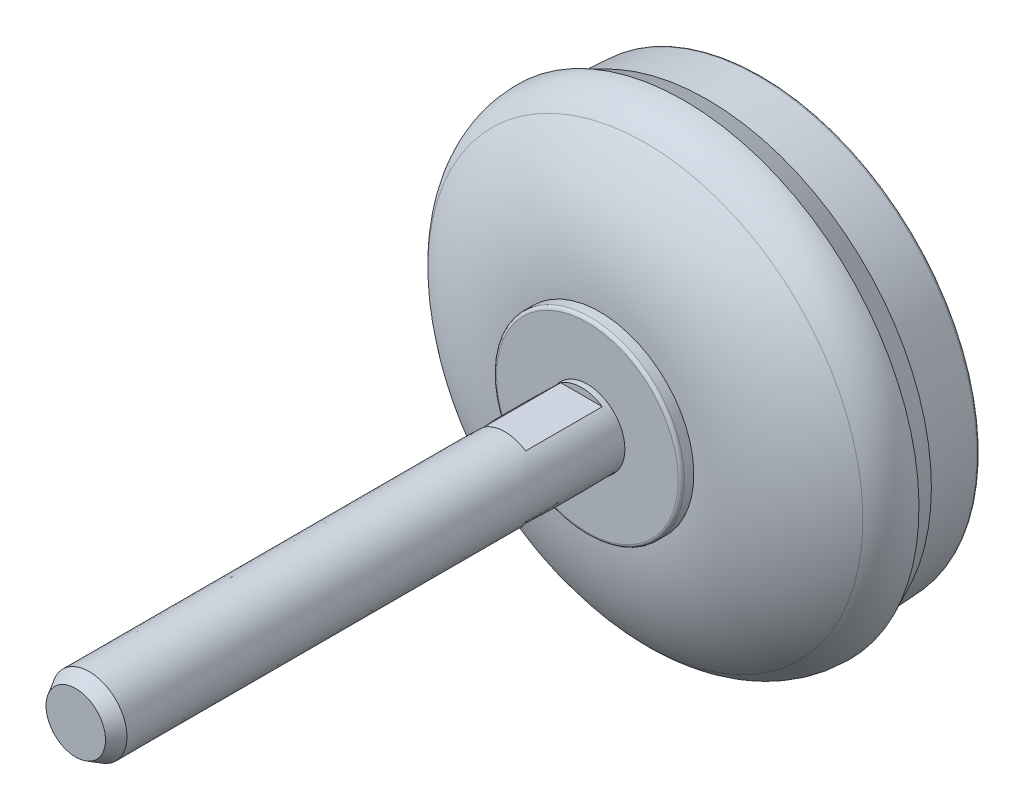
ISO-10303-21;
HEADER;
FILE_DESCRIPTION(('STEP AP214'),'2;1');
FILE_NAME('part.step','',(''),(''),'','','');
FILE_SCHEMA(('AUTOMOTIVE_DESIGN { 1 0 10303 214 1 1 1 1 }'));
ENDSEC;
DATA;
#1=APPLICATION_CONTEXT('core data for automotive mechanical design processes');
#2=APPLICATION_PROTOCOL_DEFINITION('international standard','automotive_design',2000,#1);
#3=PRODUCT_CONTEXT('',#1,'mechanical');
#4=PRODUCT('Part','Part','',(#3));
#5=PRODUCT_RELATED_PRODUCT_CATEGORY('part','',(#4));
#6=PRODUCT_DEFINITION_FORMATION('','',#4);
#7=PRODUCT_DEFINITION_CONTEXT('part definition',#1,'design');
#8=PRODUCT_DEFINITION('design','',#6,#7);
#9=PRODUCT_DEFINITION_SHAPE('','',#8);
#10=(LENGTH_UNIT() NAMED_UNIT(*) SI_UNIT(.MILLI.,.METRE.));
#11=(NAMED_UNIT(*) PLANE_ANGLE_UNIT() SI_UNIT($,.RADIAN.));
#12=(NAMED_UNIT(*) SI_UNIT($,.STERADIAN.) SOLID_ANGLE_UNIT());
#13=UNCERTAINTY_MEASURE_WITH_UNIT(LENGTH_MEASURE(1.E-05),#10,'distance_accuracy_value','');
#14=(GEOMETRIC_REPRESENTATION_CONTEXT(3) GLOBAL_UNCERTAINTY_ASSIGNED_CONTEXT((#13)) GLOBAL_UNIT_ASSIGNED_CONTEXT((#10,
#11,#12)) REPRESENTATION_CONTEXT('',''));
#15=CARTESIAN_POINT('',(0.,0.,0.));
#16=DIRECTION('',(0.,0.,1.));
#17=DIRECTION('',(1.,0.,0.));
#18=AXIS2_PLACEMENT_3D('',#15,#16,#17);
#19=CARTESIAN_POINT('',(32.3879992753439,228.506021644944,27.3305440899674));
#20=DIRECTION('',(2.62472022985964E-07,0.,-0.999999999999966));
#21=DIRECTION('',(-0.999999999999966,0.,-2.62472022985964E-07));
#22=AXIS2_PLACEMENT_3D('',#19,#20,#21);
#23=CONICAL_SURFACE('',#22,6.00001756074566,2.12237210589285E-07);
#24=CARTESIAN_POINT('',(32.3879784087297,228.506021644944,106.833632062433));
#25=DIRECTION('',(2.62462941E-07,0.,-0.999999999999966));
#26=DIRECTION('',(-0.999999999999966,0.,-2.62462941E-07));
#27=AXIS2_PLACEMENT_3D('',#24,#25,#26);
#28=CIRCLE('',#27,6.00000068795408);
#29=CARTESIAN_POINT('',(26.3879777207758,228.506021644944,106.833630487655));
#30=VERTEX_POINT('',#29);
#31=EDGE_CURVE('P0_E100',#30,#30,#28,.T.);
#32=ORIENTED_EDGE('',*,*,#31,.T.);
#33=EDGE_LOOP('',(#32));
#34=FACE_BOUND('',#33,.T.);
#35=CARTESIAN_POINT('',(32.3879992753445,228.506021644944,27.3305418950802));
#36=DIRECTION('',(-2.62462941E-07,0.,0.999999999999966));
#37=DIRECTION('',(0.999999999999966,0.,2.62462941E-07));
#38=AXIS2_PLACEMENT_3D('',#35,#36,#37);
#39=CIRCLE('',#38,6.00001756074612);
#40=CARTESIAN_POINT('',(38.3880168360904,228.506021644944,27.3305434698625));
#41=VERTEX_POINT('',#40);
#42=EDGE_CURVE('P0_E150',#41,#41,#39,.T.);
#43=ORIENTED_EDGE('',*,*,#42,.T.);
#44=EDGE_LOOP('',(#43));
#45=FACE_BOUND('',#44,.T.);
#46=CARTESIAN_POINT('',(32.3879990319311,228.506021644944,28.2579312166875));
#47=DIRECTION('',(0.,0.,1.));
#48=DIRECTION('',(1.,0.,0.));
#49=AXIS2_PLACEMENT_3D('',#46,#47,#48);
#50=CIRCLE('',#49,6.0000173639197);
#51=CARTESIAN_POINT('',(35.7046552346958,223.506021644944,28.2579312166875));
#52=VERTEX_POINT('',#51);
#53=CARTESIAN_POINT('',(29.0713448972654,223.506021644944,28.2579312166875));
#54=VERTEX_POINT('',#53);
#55=EDGE_CURVE('P0_E92',#52,#54,#50,.F.);
#56=ORIENTED_EDGE('',*,*,#55,.T.);
#57=CARTESIAN_POINT('',(29.0713415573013,223.506021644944,17.7879109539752));
#58=CARTESIAN_POINT('',(29.0713420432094,223.506021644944,21.7879214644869));
#59=CARTESIAN_POINT('',(29.0713425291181,223.506021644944,25.7879319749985));
#60=CARTESIAN_POINT('',(29.0713435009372,223.506021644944,33.7879529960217));
#61=CARTESIAN_POINT('',(29.0713439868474,223.506021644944,37.7879635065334));
#62=CARTESIAN_POINT('',(29.0713457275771,223.506021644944,52.1176190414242));
#63=CARTESIAN_POINT('',(29.0713469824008,223.506021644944,62.4472640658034));
#64=CARTESIAN_POINT('',(29.0713482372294,223.506021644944,72.7769090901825));
#65=B_SPLINE_CURVE_WITH_KNOTS('',3,(#57,#58,#59,#60,#61,#62,#63,#64),.UNSPECIFIED.,.F.,.F.,(4,2,
2,4),(0.,12.000031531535,24.0000630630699,54.9889981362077),.UNSPECIFIED.);
#66=CARTESIAN_POINT('',(29.0713448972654,223.506021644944,40.4980218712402));
#67=VERTEX_POINT('',#66);
#68=EDGE_CURVE('P0_E80',#54,#67,#65,.T.);
#69=ORIENTED_EDGE('',*,*,#68,.T.);
#70=CARTESIAN_POINT('',(32.3879958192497,228.506021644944,40.4980218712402));
#71=DIRECTION('',(0.,0.,-1.));
#72=DIRECTION('',(-1.,0.,0.));
#73=AXIS2_PLACEMENT_3D('',#70,#71,#72);
#74=CIRCLE('',#73,6.00001476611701);
#75=CARTESIAN_POINT('',(35.7046473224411,223.506021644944,40.4980218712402));
#76=VERTEX_POINT('',#75);
#77=EDGE_CURVE('P0_E88',#67,#76,#74,.F.);
#78=ORIENTED_EDGE('',*,*,#77,.T.);
#79=CARTESIAN_POINT('',(35.7046620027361,223.506021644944,17.7879103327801));
#80=CARTESIAN_POINT('',(35.7046594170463,223.506021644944,21.7879208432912));
#81=CARTESIAN_POINT('',(35.7046568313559,223.506021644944,25.7879313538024));
#82=CARTESIAN_POINT('',(35.7046516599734,223.506021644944,33.7879523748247));
#83=CARTESIAN_POINT('',(35.7046490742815,223.506021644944,37.7879628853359));
#84=CARTESIAN_POINT('',(35.7046398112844,223.506021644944,52.1176184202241));
#85=CARTESIAN_POINT('',(35.7046331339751,223.506021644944,62.4472634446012));
#86=CARTESIAN_POINT('',(35.7046264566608,223.506021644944,72.7769084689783));
#87=B_SPLINE_CURVE_WITH_KNOTS('',3,(#79,#80,#81,#82,#83,#84,#85,#86),.UNSPECIFIED.,.F.,.F.,(4,2,
2,4),(0.,12.000031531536,24.0000630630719,54.9889981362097),.UNSPECIFIED.);
#88=EDGE_CURVE('P0_E97',#76,#52,#87,.F.);
#89=ORIENTED_EDGE('',*,*,#88,.T.);
#90=EDGE_LOOP('',(#56,#69,#78,#89));
#91=FACE_BOUND('',#90,.T.);
#92=CARTESIAN_POINT('',(32.3879958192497,228.506021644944,40.4980218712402));
#93=DIRECTION('',(0.,0.,-1.));
#94=DIRECTION('',(-1.,0.,0.));
#95=AXIS2_PLACEMENT_3D('',#92,#93,#94);
#96=CIRCLE('',#95,6.00001476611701);
#97=CARTESIAN_POINT('',(35.7046473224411,233.506021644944,40.4980218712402));
#98=VERTEX_POINT('',#97);
#99=CARTESIAN_POINT('',(29.0713448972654,233.506021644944,40.4980218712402));
#100=VERTEX_POINT('',#99);
#101=EDGE_CURVE('P0_E460',#98,#100,#96,.F.);
#102=ORIENTED_EDGE('',*,*,#101,.T.);
#103=CARTESIAN_POINT('',(29.0713415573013,233.506021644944,17.7879109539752));
#104=CARTESIAN_POINT('',(29.0713420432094,233.506021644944,21.7879214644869));
#105=CARTESIAN_POINT('',(29.0713425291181,233.506021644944,25.7879319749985));
#106=CARTESIAN_POINT('',(29.0713435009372,233.506021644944,33.7879529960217));
#107=CARTESIAN_POINT('',(29.0713439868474,233.506021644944,37.7879635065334));
#108=CARTESIAN_POINT('',(29.0713457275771,233.506021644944,52.1176190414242));
#109=CARTESIAN_POINT('',(29.0713469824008,233.506021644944,62.4472640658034));
#110=CARTESIAN_POINT('',(29.0713482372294,233.506021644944,72.7769090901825));
#111=B_SPLINE_CURVE_WITH_KNOTS('',3,(#103,#104,#105,#106,#107,#108,#109,#110),.UNSPECIFIED.,.F.,
.F.,(4,2,2,4),(0.,12.000031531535,24.0000630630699,54.9889981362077),.UNSPECIFIED.);
#112=CARTESIAN_POINT('',(29.0713448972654,233.506021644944,28.2579312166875));
#113=VERTEX_POINT('',#112);
#114=EDGE_CURVE('P0_E11',#100,#113,#111,.F.);
#115=ORIENTED_EDGE('',*,*,#114,.T.);
#116=CARTESIAN_POINT('',(32.3879990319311,228.506021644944,28.2579312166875));
#117=DIRECTION('',(0.,0.,1.));
#118=DIRECTION('',(1.,0.,0.));
#119=AXIS2_PLACEMENT_3D('',#116,#117,#118);
#120=CIRCLE('',#119,6.0000173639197);
#121=CARTESIAN_POINT('',(35.7046552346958,233.506021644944,28.2579312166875));
#122=VERTEX_POINT('',#121);
#123=EDGE_CURVE('P0_E48',#113,#122,#120,.F.);
#124=ORIENTED_EDGE('',*,*,#123,.T.);
#125=CARTESIAN_POINT('',(35.7046620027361,233.506021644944,17.7879103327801));
#126=CARTESIAN_POINT('',(35.7046594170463,233.506021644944,21.7879208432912));
#127=CARTESIAN_POINT('',(35.7046568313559,233.506021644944,25.7879313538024));
#128=CARTESIAN_POINT('',(35.7046516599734,233.506021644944,33.7879523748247));
#129=CARTESIAN_POINT('',(35.7046490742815,233.506021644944,37.7879628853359));
#130=CARTESIAN_POINT('',(35.7046398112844,233.506021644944,52.1176184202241));
#131=CARTESIAN_POINT('',(35.7046331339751,233.506021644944,62.4472634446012));
#132=CARTESIAN_POINT('',(35.7046264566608,233.506021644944,72.7769084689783));
#133=B_SPLINE_CURVE_WITH_KNOTS('',3,(#125,#126,#127,#128,#129,#130,#131,#132),.UNSPECIFIED.,.F.,
.F.,(4,2,2,4),(0.,12.000031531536,24.0000630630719,54.9889981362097),.UNSPECIFIED.);
#134=EDGE_CURVE('P0_E87',#122,#98,#133,.T.);
#135=ORIENTED_EDGE('',*,*,#134,.T.);
#136=EDGE_LOOP('',(#102,#115,#124,#135));
#137=FACE_BOUND('',#136,.T.);
#138=ADVANCED_FACE('P0_F34',(#34,#45,#91,#137),#23,.T.);
#139=CARTESIAN_POINT('',(27.7380649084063,228.506021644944,3.99854531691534));
#140=DIRECTION('',(2.62462941E-07,0.,-0.999999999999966));
#141=DIRECTION('',(-0.999999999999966,0.,-2.62462941E-07));
#142=AXIS2_PLACEMENT_3D('',#139,#140,#141);
#143=PLANE('',#142);
#144=CARTESIAN_POINT('',(32.3880053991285,228.506021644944,3.99854714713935));
#145=DIRECTION('',(-2.62462940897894E-07,0.,0.999999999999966));
#146=DIRECTION('',(0.999999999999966,0.,2.62462940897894E-07));
#147=AXIS2_PLACEMENT_3D('',#144,#145,#146);
#148=CIRCLE('',#147,4.64994049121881);
#149=CARTESIAN_POINT('',(37.0379458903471,228.506021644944,3.9985483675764));
#150=VERTEX_POINT('',#149);
#151=EDGE_CURVE('P0_E206',#150,#150,#148,.T.);
#152=ORIENTED_EDGE('',*,*,#151,.F.);
#153=EDGE_LOOP('',(#152));
#154=FACE_BOUND('',#153,.T.);
#155=ADVANCED_FACE('P0_F36',(#154),#143,.T.);
#156=CARTESIAN_POINT('',(32.388005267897,228.506021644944,4.49854727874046));
#157=DIRECTION('',(-2.62462940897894E-07,0.,0.999999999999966));
#158=DIRECTION('',(0.999999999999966,0.,2.62462940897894E-07));
#159=AXIS2_PLACEMENT_3D('',#156,#157,#158);
#160=CONICAL_SURFACE('',#159,5.14993883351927,0.785396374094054);
#161=ORIENTED_EDGE('',*,*,#151,.T.);
#162=EDGE_LOOP('',(#161));
#163=FACE_BOUND('',#162,.T.);
#164=CARTESIAN_POINT('',(32.388005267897,228.506021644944,4.49854727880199));
#165=DIRECTION('',(-2.62462941E-07,0.,0.999999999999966));
#166=DIRECTION('',(0.999999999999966,0.,2.62462941E-07));
#167=AXIS2_PLACEMENT_3D('',#164,#165,#166);
#168=CIRCLE('',#167,5.14993830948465);
#169=CARTESIAN_POINT('',(37.5379435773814,228.506021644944,4.49854863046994));
#170=VERTEX_POINT('',#169);
#171=EDGE_CURVE('P0_E203',#170,#170,#168,.T.);
#172=ORIENTED_EDGE('',*,*,#171,.F.);
#173=EDGE_LOOP('',(#172));
#174=FACE_BOUND('',#173,.T.);
#175=ADVANCED_FACE('P0_F139',(#163,#174),#160,.T.);
#176=CARTESIAN_POINT('',(32.3879778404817,228.506021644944,108.998692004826));
#177=DIRECTION('',(-2.62462941E-07,0.,0.999999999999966));
#178=DIRECTION('',(0.999999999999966,0.,2.62462941E-07));
#179=AXIS2_PLACEMENT_3D('',#176,#177,#178);
#180=CYLINDRICAL_SURFACE('',#179,5.14993830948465);
#181=ORIENTED_EDGE('',*,*,#171,.T.);
#182=EDGE_LOOP('',(#181));
#183=FACE_BOUND('',#182,.T.);
#184=CARTESIAN_POINT('',(32.3880042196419,228.506021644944,8.49246386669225));
#185=DIRECTION('',(-2.62462941E-07,0.,0.999999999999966));
#186=DIRECTION('',(0.999999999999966,0.,2.62462941E-07));
#187=AXIS2_PLACEMENT_3D('',#184,#185,#186);
#188=CIRCLE('',#187,5.14993830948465);
#189=CARTESIAN_POINT('',(37.5379425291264,228.506021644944,8.49246521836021));
#190=VERTEX_POINT('',#189);
#191=EDGE_CURVE('P0_E198',#190,#190,#188,.F.);
#192=ORIENTED_EDGE('',*,*,#191,.T.);
#193=EDGE_LOOP('',(#192));
#194=FACE_BOUND('',#193,.T.);
#195=ADVANCED_FACE('P0_F309',(#183,#194),#180,.T.);
#196=CARTESIAN_POINT('',(27.238066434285,228.506021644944,8.49246246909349));
#197=DIRECTION('',(2.62462941E-07,0.,-0.999999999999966));
#198=DIRECTION('',(-0.999999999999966,0.,-2.62462941E-07));
#199=AXIS2_PLACEMENT_3D('',#196,#197,#198);
#200=PLANE('',#199);
#201=CARTESIAN_POINT('',(32.3880042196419,228.506021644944,8.49246377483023));
#202=DIRECTION('',(-2.62462941E-07,0.,0.999999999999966));
#203=DIRECTION('',(0.999999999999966,0.,2.62462941E-07));
#204=AXIS2_PLACEMENT_3D('',#201,#202,#203);
#205=CIRCLE('',#204,4.79993764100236);
#206=CARTESIAN_POINT('',(37.1879418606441,228.506021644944,8.49246503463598));
#207=VERTEX_POINT('',#206);
#208=EDGE_CURVE('P0_E193',#207,#207,#205,.T.);
#209=ORIENTED_EDGE('',*,*,#208,.F.);
#210=EDGE_LOOP('',(#209));
#211=FACE_BOUND('',#210,.T.);
#212=ORIENTED_EDGE('',*,*,#191,.F.);
#213=EDGE_LOOP('',(#212));
#214=FACE_BOUND('',#213,.T.);
#215=ADVANCED_FACE('P0_F305',(#211,#214),#200,.F.);
#216=CARTESIAN_POINT('',(32.3879778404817,228.506021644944,108.998692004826));
#217=DIRECTION('',(-2.62462941E-07,0.,0.999999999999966));
#218=DIRECTION('',(0.999999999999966,0.,2.62462941E-07));
#219=AXIS2_PLACEMENT_3D('',#216,#217,#218);
#220=CYLINDRICAL_SURFACE('',#219,4.79993764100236);
#221=ORIENTED_EDGE('',*,*,#208,.T.);
#222=EDGE_LOOP('',(#221));
#223=FACE_BOUND('',#222,.T.);
#224=CARTESIAN_POINT('',(32.3880039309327,228.506021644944,9.59246377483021));
#225=DIRECTION('',(-2.62462941E-07,0.,0.999999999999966));
#226=DIRECTION('',(0.999999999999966,0.,2.62462941E-07));
#227=AXIS2_PLACEMENT_3D('',#224,#225,#226);
#228=CIRCLE('',#227,4.79993764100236);
#229=CARTESIAN_POINT('',(37.1879415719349,228.506021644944,9.59246503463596));
#230=VERTEX_POINT('',#229);
#231=EDGE_CURVE('P0_E188',#230,#230,#228,.T.);
#232=ORIENTED_EDGE('',*,*,#231,.F.);
#233=EDGE_LOOP('',(#232));
#234=FACE_BOUND('',#233,.T.);
#235=ADVANCED_FACE('P0_F301',(#223,#234),#220,.T.);
#236=CARTESIAN_POINT('',(27.238066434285,228.506021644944,9.59246246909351));
#237=DIRECTION('',(2.62462941E-07,0.,-0.999999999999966));
#238=DIRECTION('',(-0.999999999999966,0.,-2.62462941E-07));
#239=AXIS2_PLACEMENT_3D('',#236,#237,#238);
#240=PLANE('',#239);
#241=ORIENTED_EDGE('',*,*,#231,.T.);
#242=EDGE_LOOP('',(#241));
#243=FACE_BOUND('',#242,.T.);
#244=CARTESIAN_POINT('',(32.3880039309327,228.506021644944,9.59246386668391));
#245=DIRECTION('',(2.62473522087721E-07,0.,-0.999999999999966));
#246=DIRECTION('',(-0.999999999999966,0.,-2.62473522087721E-07));
#247=AXIS2_PLACEMENT_3D('',#244,#245,#246);
#248=CIRCLE('',#247,5.14993749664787);
#249=CARTESIAN_POINT('',(27.238066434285,228.506021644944,9.59246251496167));
#250=VERTEX_POINT('',#249);
#251=EDGE_CURVE('P0_E183',#250,#250,#248,.F.);
#252=ORIENTED_EDGE('',*,*,#251,.F.);
#253=EDGE_LOOP('',(#252));
#254=FACE_BOUND('',#253,.T.);
#255=ADVANCED_FACE('P0_F297',(#243,#254),#240,.T.);
#256=CARTESIAN_POINT('',(32.3880039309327,228.506021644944,9.59246386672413));
#257=DIRECTION('',(2.62473522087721E-07,0.,-0.999999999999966));
#258=DIRECTION('',(-0.999999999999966,0.,-2.62473522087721E-07));
#259=AXIS2_PLACEMENT_3D('',#256,#257,#258);
#260=CONICAL_SURFACE('',#259,5.14993749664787,9.40473719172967E-06);
#261=CARTESIAN_POINT('',(32.3880030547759,228.506021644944,12.930540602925));
#262=DIRECTION('',(2.62473522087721E-07,0.,-0.999999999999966));
#263=DIRECTION('',(-0.999999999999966,0.,-2.62473522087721E-07));
#264=AXIS2_PLACEMENT_3D('',#261,#262,#263);
#265=CIRCLE('',#264,5.14990610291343);
#266=CARTESIAN_POINT('',(27.2380969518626,228.506021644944,12.930539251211));
#267=VERTEX_POINT('',#266);
#268=EDGE_CURVE('P0_E178',#267,#267,#265,.T.);
#269=ORIENTED_EDGE('',*,*,#268,.T.);
#270=EDGE_LOOP('',(#269));
#271=FACE_BOUND('',#270,.T.);
#272=ORIENTED_EDGE('',*,*,#251,.T.);
#273=EDGE_LOOP('',(#272));
#274=FACE_BOUND('',#273,.T.);
#275=ADVANCED_FACE('P0_F293',(#271,#274),#260,.T.);
#276=CARTESIAN_POINT('',(27.2380969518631,228.506021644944,12.9305392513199));
#277=DIRECTION('',(2.62462941E-07,0.,-0.999999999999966));
#278=DIRECTION('',(-0.999999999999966,0.,-2.62462941E-07));
#279=AXIS2_PLACEMENT_3D('',#276,#277,#278);
#280=PLANE('',#279);
#281=CARTESIAN_POINT('',(32.3880030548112,228.506021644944,12.9305405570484));
#282=DIRECTION('',(-2.62462941E-07,0.,0.999999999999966));
#283=DIRECTION('',(0.999999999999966,0.,2.62462941E-07));
#284=AXIS2_PLACEMENT_3D('',#281,#282,#283);
#285=CIRCLE('',#284,4.79990595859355);
#286=CARTESIAN_POINT('',(37.1879090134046,228.506021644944,12.9305418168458));
#287=VERTEX_POINT('',#286);
#288=EDGE_CURVE('P0_E173',#287,#287,#285,.T.);
#289=ORIENTED_EDGE('',*,*,#288,.F.);
#290=EDGE_LOOP('',(#289));
#291=FACE_BOUND('',#290,.T.);
#292=ORIENTED_EDGE('',*,*,#268,.F.);
#293=EDGE_LOOP('',(#292));
#294=FACE_BOUND('',#293,.T.);
#295=ADVANCED_FACE('P0_F289',(#291,#294),#280,.F.);
#296=CARTESIAN_POINT('',(32.3879778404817,228.506021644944,108.998692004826));
#297=DIRECTION('',(-2.62462941E-07,0.,0.999999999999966));
#298=DIRECTION('',(0.999999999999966,0.,2.62462941E-07));
#299=AXIS2_PLACEMENT_3D('',#296,#297,#298);
#300=CYLINDRICAL_SURFACE('',#299,4.79990595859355);
#301=ORIENTED_EDGE('',*,*,#288,.T.);
#302=EDGE_LOOP('',(#301));
#303=FACE_BOUND('',#302,.T.);
#304=CARTESIAN_POINT('',(32.388002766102,228.506021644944,14.0305405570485));
#305=DIRECTION('',(-2.62462941E-07,0.,0.999999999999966));
#306=DIRECTION('',(0.999999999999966,0.,2.62462941E-07));
#307=AXIS2_PLACEMENT_3D('',#304,#305,#306);
#308=CIRCLE('',#307,4.79990595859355);
#309=CARTESIAN_POINT('',(37.1879087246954,228.506021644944,14.0305418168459));
#310=VERTEX_POINT('',#309);
#311=EDGE_CURVE('P0_E168',#310,#310,#308,.T.);
#312=ORIENTED_EDGE('',*,*,#311,.F.);
#313=EDGE_LOOP('',(#312));
#314=FACE_BOUND('',#313,.T.);
#315=ADVANCED_FACE('P0_F282',(#303,#314),#300,.T.);
#316=CARTESIAN_POINT('',(27.2380664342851,228.506021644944,14.0305398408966));
#317=DIRECTION('',(2.62462941E-07,0.,-0.999999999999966));
#318=DIRECTION('',(-0.999999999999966,0.,-2.62462941E-07));
#319=AXIS2_PLACEMENT_3D('',#316,#317,#318);
#320=PLANE('',#319);
#321=ORIENTED_EDGE('',*,*,#311,.T.);
#322=EDGE_LOOP('',(#321));
#323=FACE_BOUND('',#322,.T.);
#324=CARTESIAN_POINT('',(32.3880027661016,228.506021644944,14.0305418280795));
#325=DIRECTION('',(-2.62462941E-07,0.,0.999999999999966));
#326=DIRECTION('',(0.999999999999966,0.,2.62462941E-07));
#327=AXIS2_PLACEMENT_3D('',#324,#325,#326);
#328=CIRCLE('',#327,5.14993574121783);
#329=CARTESIAN_POINT('',(37.5379385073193,228.506021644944,14.0305431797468));
#330=VERTEX_POINT('',#329);
#331=EDGE_CURVE('P0_E164',#330,#330,#328,.T.);
#332=ORIENTED_EDGE('',*,*,#331,.F.);
#333=EDGE_LOOP('',(#332));
#334=FACE_BOUND('',#333,.T.);
#335=ADVANCED_FACE('P0_F277',(#323,#334),#320,.T.);
#336=CARTESIAN_POINT('',(32.3879778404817,228.506021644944,108.998692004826));
#337=DIRECTION('',(-2.62462941E-07,0.,0.999999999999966));
#338=DIRECTION('',(0.999999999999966,0.,2.62462941E-07));
#339=AXIS2_PLACEMENT_3D('',#336,#337,#338);
#340=CYLINDRICAL_SURFACE('',#339,5.14993574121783);
#341=ORIENTED_EDGE('',*,*,#331,.T.);
#342=EDGE_LOOP('',(#341));
#343=FACE_BOUND('',#342,.T.);
#344=CARTESIAN_POINT('',(32.3880015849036,228.506021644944,18.5309793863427));
#345=DIRECTION('',(2.62462941E-07,0.,-0.999999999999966));
#346=DIRECTION('',(-0.999999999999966,0.,-2.62462939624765E-07));
#347=AXIS2_PLACEMENT_3D('',#344,#345,#346);
#348=CIRCLE('',#347,5.1499351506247);
#349=CARTESIAN_POINT('',(27.2380664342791,228.506021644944,18.5309780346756));
#350=VERTEX_POINT('',#349);
#351=EDGE_CURVE('P0_E167',#350,#350,#348,.F.);
#352=ORIENTED_EDGE('',*,*,#351,.F.);
#353=EDGE_LOOP('',(#352));
#354=FACE_BOUND('',#353,.T.);
#355=ADVANCED_FACE('P0_F273',(#343,#354),#340,.T.);
#356=CARTESIAN_POINT('',(32.3880015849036,228.506021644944,18.5309793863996));
#357=DIRECTION('',(2.62462942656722E-07,0.,-0.999999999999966));
#358=DIRECTION('',(-0.999999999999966,0.,-2.62462942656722E-07));
#359=AXIS2_PLACEMENT_3D('',#356,#357,#358);
#360=CONICAL_SURFACE('',#359,5.14993515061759,0.0959933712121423);
#361=CARTESIAN_POINT('',(32.3879995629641,228.506021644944,26.234693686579));
#362=DIRECTION('',(-2.62462941E-07,0.,0.999999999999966));
#363=DIRECTION('',(0.999999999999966,0.,2.62462941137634E-07));
#364=AXIS2_PLACEMENT_3D('',#361,#362,#363);
#365=CIRCLE('',#364,4.40814979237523);
#366=CARTESIAN_POINT('',(36.7961493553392,228.506021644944,26.2346948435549));
#367=VERTEX_POINT('',#366);
#368=EDGE_CURVE('P0_E263',#367,#367,#365,.F.);
#369=ORIENTED_EDGE('',*,*,#368,.T.);
#370=EDGE_LOOP('',(#369));
#371=FACE_BOUND('',#370,.T.);
#372=ORIENTED_EDGE('',*,*,#351,.T.);
#373=EDGE_LOOP('',(#372));
#374=FACE_BOUND('',#373,.T.);
#375=ADVANCED_FACE('P0_F247',(#371,#374),#360,.T.);
#376=CARTESIAN_POINT('',(32.387999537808,228.506021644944,26.3305397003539));
#377=DIRECTION('',(-2.62462941E-07,0.,0.999999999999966));
#378=DIRECTION('',(0.999999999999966,0.,2.62462941E-07));
#379=AXIS2_PLACEMENT_3D('',#376,#377,#378);
#380=TOROIDAL_SURFACE('',#379,5.40354596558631,0.999999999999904);
#381=ORIENTED_EDGE('',*,*,#368,.F.);
#382=EDGE_LOOP('',(#381));
#383=FACE_BOUND('',#382,.T.);
#384=CARTESIAN_POINT('',(32.3879992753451,228.506021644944,27.3305397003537));
#385=DIRECTION('',(2.62462941E-07,0.,-0.999999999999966));
#386=DIRECTION('',(0.999999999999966,0.,2.62462941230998E-07));
#387=AXIS2_PLACEMENT_3D('',#384,#385,#386);
#388=CIRCLE('',#387,5.40354570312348);
#389=CARTESIAN_POINT('',(37.7915449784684,228.506021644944,27.3305411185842));
#390=VERTEX_POINT('',#389);
#391=EDGE_CURVE('P0_E156',#390,#390,#388,.T.);
#392=ORIENTED_EDGE('',*,*,#391,.T.);
#393=EDGE_LOOP('',(#392));
#394=FACE_BOUND('',#393,.T.);
#395=ADVANCED_FACE('P0_F242',(#383,#394),#380,.F.);
#396=CARTESIAN_POINT('',(27.6379765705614,228.506021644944,108.998691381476));
#397=DIRECTION('',(2.62462941E-07,0.,-0.999999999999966));
#398=DIRECTION('',(-0.999999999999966,0.,-2.62462941E-07));
#399=AXIS2_PLACEMENT_3D('',#396,#397,#398);
#400=PLANE('',#399);
#401=CARTESIAN_POINT('',(32.3879778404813,228.506021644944,108.998693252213));
#402=DIRECTION('',(2.6246294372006E-07,0.,-0.999999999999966));
#403=DIRECTION('',(-0.999999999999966,0.,-2.6246294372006E-07));
#404=AXIS2_PLACEMENT_3D('',#401,#402,#403);
#405=CIRCLE('',#404,4.75000127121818);
#406=CARTESIAN_POINT('',(27.6379765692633,228.506021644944,108.998692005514));
#407=VERTEX_POINT('',#406);
#408=EDGE_CURVE('P0_E152',#407,#407,#405,.T.);
#409=ORIENTED_EDGE('',*,*,#408,.F.);
#410=EDGE_LOOP('',(#409));
#411=FACE_BOUND('',#410,.T.);
#412=ADVANCED_FACE('P0_F239',(#411),#400,.F.);
#413=CARTESIAN_POINT('',(26.9844535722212,228.506021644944,27.3305404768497));
#414=DIRECTION('',(-2.62462941E-07,0.,0.999999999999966));
#415=DIRECTION('',(0.999999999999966,0.,2.62462941E-07));
#416=AXIS2_PLACEMENT_3D('',#413,#414,#415);
#417=PLANE('',#416);
#418=ORIENTED_EDGE('',*,*,#391,.F.);
#419=EDGE_LOOP('',(#418));
#420=FACE_BOUND('',#419,.T.);
#421=ORIENTED_EDGE('',*,*,#42,.F.);
#422=EDGE_LOOP('',(#421));
#423=FACE_BOUND('',#422,.T.);
#424=ADVANCED_FACE('P0_F136',(#420,#423),#417,.F.);
#425=CARTESIAN_POINT('',(32.3879784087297,228.506021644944,106.833632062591));
#426=DIRECTION('',(2.6246294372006E-07,0.,-0.999999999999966));
#427=DIRECTION('',(-0.999999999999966,0.,-2.6246294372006E-07));
#428=AXIS2_PLACEMENT_3D('',#425,#426,#427);
#429=CONICAL_SURFACE('',#428,6.00000068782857,0.523599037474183);
#430=ORIENTED_EDGE('',*,*,#408,.T.);
#431=EDGE_LOOP('',(#430));
#432=FACE_BOUND('',#431,.T.);
#433=ORIENTED_EDGE('',*,*,#31,.F.);
#434=EDGE_LOOP('',(#433));
#435=FACE_BOUND('',#434,.T.);
#436=ADVANCED_FACE('P0_F131',(#432,#435),#429,.T.);
#437=CARTESIAN_POINT('',(69.8820270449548,223.506021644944,40.4980218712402));
#438=DIRECTION('',(0.,0.,-1.));
#439=DIRECTION('',(-1.,0.,0.));
#440=AXIS2_PLACEMENT_3D('',#437,#438,#439);
#441=PLANE('',#440);
#442=DIRECTION('',(-1.,0.,0.));
#443=VECTOR('',#442,1.);
#444=CARTESIAN_POINT('',(69.8820270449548,223.506021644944,40.4980218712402));
#445=LINE('',#444,#443);
#446=EDGE_CURVE('P0_E83',#76,#67,#445,.T.);
#447=ORIENTED_EDGE('',*,*,#446,.F.);
#448=ORIENTED_EDGE('',*,*,#77,.F.);
#449=EDGE_LOOP('',(#447,#448));
#450=FACE_BOUND('',#449,.T.);
#451=ADVANCED_FACE('P0_F129',(#450),#441,.T.);
#452=CARTESIAN_POINT('',(69.8820270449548,220.889202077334,28.2579312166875));
#453=DIRECTION('',(0.,0.,1.));
#454=DIRECTION('',(1.,0.,0.));
#455=AXIS2_PLACEMENT_3D('',#452,#453,#454);
#456=PLANE('',#455);
#457=DIRECTION('',(-1.,0.,0.));
#458=VECTOR('',#457,1.);
#459=CARTESIAN_POINT('',(69.8820270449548,223.506021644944,28.2579312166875));
#460=LINE('',#459,#458);
#461=EDGE_CURVE('P0_E63',#52,#54,#460,.T.);
#462=ORIENTED_EDGE('',*,*,#461,.T.);
#463=ORIENTED_EDGE('',*,*,#55,.F.);
#464=EDGE_LOOP('',(#462,#463));
#465=FACE_BOUND('',#464,.T.);
#466=ADVANCED_FACE('P0_F91',(#465),#456,.T.);
#467=CARTESIAN_POINT('',(69.8820270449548,223.506021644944,28.2579312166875));
#468=DIRECTION('',(0.,-1.,0.));
#469=DIRECTION('',(0.,0.,-1.));
#470=AXIS2_PLACEMENT_3D('',#467,#468,#469);
#471=PLANE('',#470);
#472=ORIENTED_EDGE('',*,*,#461,.F.);
#473=ORIENTED_EDGE('',*,*,#88,.F.);
#474=ORIENTED_EDGE('',*,*,#446,.T.);
#475=ORIENTED_EDGE('',*,*,#68,.F.);
#476=EDGE_LOOP('',(#472,#473,#474,#475));
#477=FACE_BOUND('',#476,.T.);
#478=ADVANCED_FACE('P0_F81',(#477),#471,.T.);
#479=CARTESIAN_POINT('',(69.8820270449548,236.122841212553,28.2579312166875));
#480=DIRECTION('',(0.,0.,1.));
#481=DIRECTION('',(1.,0.,0.));
#482=AXIS2_PLACEMENT_3D('',#479,#480,#481);
#483=PLANE('',#482);
#484=DIRECTION('',(-1.,0.,0.));
#485=VECTOR('',#484,1.);
#486=CARTESIAN_POINT('',(69.8820270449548,233.506021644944,28.2579312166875));
#487=LINE('',#486,#485);
#488=EDGE_CURVE('P0_E94',#122,#113,#487,.T.);
#489=ORIENTED_EDGE('',*,*,#488,.F.);
#490=ORIENTED_EDGE('',*,*,#123,.F.);
#491=EDGE_LOOP('',(#489,#490));
#492=FACE_BOUND('',#491,.T.);
#493=ADVANCED_FACE('P0_F125',(#492),#483,.T.);
#494=CARTESIAN_POINT('',(69.8820270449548,233.506021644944,40.4980218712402));
#495=DIRECTION('',(0.,0.,-1.));
#496=DIRECTION('',(-1.,0.,0.));
#497=AXIS2_PLACEMENT_3D('',#494,#495,#496);
#498=PLANE('',#497);
#499=DIRECTION('',(-1.,0.,0.));
#500=VECTOR('',#499,1.);
#501=CARTESIAN_POINT('',(69.8820270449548,233.506021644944,40.4980218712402));
#502=LINE('',#501,#500);
#503=EDGE_CURVE('P0_E55',#98,#100,#502,.T.);
#504=ORIENTED_EDGE('',*,*,#503,.T.);
#505=ORIENTED_EDGE('',*,*,#101,.F.);
#506=EDGE_LOOP('',(#504,#505));
#507=FACE_BOUND('',#506,.T.);
#508=ADVANCED_FACE('P0_F436',(#507),#498,.T.);
#509=CARTESIAN_POINT('',(69.8820270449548,233.506021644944,28.2579312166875));
#510=DIRECTION('',(0.,1.,0.));
#511=DIRECTION('',(0.,0.,1.));
#512=AXIS2_PLACEMENT_3D('',#509,#510,#511);
#513=PLANE('',#512);
#514=ORIENTED_EDGE('',*,*,#503,.F.);
#515=ORIENTED_EDGE('',*,*,#134,.F.);
#516=ORIENTED_EDGE('',*,*,#488,.T.);
#517=ORIENTED_EDGE('',*,*,#114,.F.);
#518=EDGE_LOOP('',(#514,#515,#516,#517));
#519=FACE_BOUND('',#518,.T.);
#520=ADVANCED_FACE('P0_F445',(#519),#513,.T.);
#521=CLOSED_SHELL('',(#138,#155,#175,#195,#215,#235,#255,#275,#295,#315,#335,#355,#375,#395,
#412,#424,#436,#451,#466,#478,#493,#508,#520));
#522=MANIFOLD_SOLID_BREP('P0_B2',#521);
#523=CARTESIAN_POINT('',(32.3880004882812,228.506021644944,2.788368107E-06));
#524=DIRECTION('',(0.,0.,1.));
#525=DIRECTION('',(0.,-1.,0.));
#526=AXIS2_PLACEMENT_3D('',#523,#524,#525);
#527=PLANE('',#526);
#528=CARTESIAN_POINT('',(32.3880022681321,228.506021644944,2.78836810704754E-06));
#529=DIRECTION('',(0.,0.,1.));
#530=DIRECTION('',(0.,-1.,0.));
#531=AXIS2_PLACEMENT_3D('',#528,#529,#530);
#532=CIRCLE('',#531,5.41879257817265);
#533=CARTESIAN_POINT('',(32.3880022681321,223.087229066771,2.78836811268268E-06));
#534=VERTEX_POINT('',#533);
#535=EDGE_CURVE('P1_E26',#534,#534,#532,.F.);
#536=ORIENTED_EDGE('',*,*,#535,.T.);
#537=EDGE_LOOP('',(#536));
#538=FACE_BOUND('',#537,.T.);
#539=ADVANCED_FACE('P1_F23',(#538),#527,.F.);
#540=CARTESIAN_POINT('',(32.3880022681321,228.506021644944,-0.500000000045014));
#541=DIRECTION('',(0.,0.,-1.));
#542=DIRECTION('',(0.,1.,0.));
#543=AXIS2_PLACEMENT_3D('',#540,#541,#542);
#544=CONICAL_SURFACE('',#543,5.91879536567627,0.785398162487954);
#545=ORIENTED_EDGE('',*,*,#535,.F.);
#546=EDGE_LOOP('',(#545));
#547=FACE_BOUND('',#546,.T.);
#548=CARTESIAN_POINT('',(32.3880022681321,228.506021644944,-0.49999999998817));
#549=DIRECTION('',(0.,0.,-1.));
#550=DIRECTION('',(0.,1.,0.));
#551=AXIS2_PLACEMENT_3D('',#548,#549,#550);
#552=CIRCLE('',#551,5.91879536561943);
#553=CARTESIAN_POINT('',(32.3880022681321,234.424817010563,-0.499999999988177));
#554=VERTEX_POINT('',#553);
#555=EDGE_CURVE('P1_E347',#554,#554,#552,.T.);
#556=ORIENTED_EDGE('',*,*,#555,.T.);
#557=EDGE_LOOP('',(#556));
#558=FACE_BOUND('',#557,.T.);
#559=ADVANCED_FACE('P1_F245',(#547,#558),#544,.F.);
#560=CARTESIAN_POINT('',(26.4692069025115,228.506021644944,-0.499999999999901));
#561=DIRECTION('',(0.,0.,1.));
#562=DIRECTION('',(0.,-1.,0.));
#563=AXIS2_PLACEMENT_3D('',#560,#561,#562);
#564=PLANE('',#563);
#565=ORIENTED_EDGE('',*,*,#555,.F.);
#566=EDGE_LOOP('',(#565));
#567=FACE_BOUND('',#566,.T.);
#568=CARTESIAN_POINT('',(32.3880022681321,228.506021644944,-0.500000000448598));
#569=DIRECTION('',(0.,0.,1.));
#570=DIRECTION('',(0.,-1.,0.));
#571=AXIS2_PLACEMENT_3D('',#568,#569,#570);
#572=CIRCLE('',#571,11.6462850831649);
#573=CARTESIAN_POINT('',(32.3880022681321,216.859736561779,-0.500000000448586));
#574=VERTEX_POINT('',#573);
#575=EDGE_CURVE('P1_E342',#574,#574,#572,.T.);
#576=ORIENTED_EDGE('',*,*,#575,.F.);
#577=EDGE_LOOP('',(#576));
#578=FACE_BOUND('',#577,.T.);
#579=ADVANCED_FACE('P1_F242',(#567,#578),#564,.F.);
#580=CARTESIAN_POINT('',(32.3880022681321,228.506021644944,-1.64494380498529E-06));
#581=DIRECTION('',(0.,0.,1.));
#582=DIRECTION('',(0.,-1.,0.));
#583=AXIS2_PLACEMENT_3D('',#580,#581,#582);
#584=CONICAL_SURFACE('',#583,12.1462929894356,0.7854077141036);
#585=ORIENTED_EDGE('',*,*,#575,.T.);
#586=EDGE_LOOP('',(#585));
#587=FACE_BOUND('',#586,.T.);
#588=CARTESIAN_POINT('',(32.3880022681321,228.506021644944,-1.64494380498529E-06));
#589=DIRECTION('',(0.,0.,1.));
#590=DIRECTION('',(0.,-1.,0.));
#591=AXIS2_PLACEMENT_3D('',#588,#589,#590);
#592=CIRCLE('',#591,12.1462929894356);
#593=CARTESIAN_POINT('',(32.3880022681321,216.359728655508,-1.64494379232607E-06));
#594=VERTEX_POINT('',#593);
#595=EDGE_CURVE('P1_E337',#594,#594,#592,.F.);
#596=ORIENTED_EDGE('',*,*,#595,.T.);
#597=EDGE_LOOP('',(#596));
#598=FACE_BOUND('',#597,.T.);
#599=ADVANCED_FACE('P1_F238',(#587,#598),#584,.T.);
#600=CARTESIAN_POINT('',(20.2417092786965,228.506021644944,-8.22472202E-07));
#601=DIRECTION('',(0.,0.,1.));
#602=DIRECTION('',(0.,-1.,0.));
#603=AXIS2_PLACEMENT_3D('',#600,#601,#602);
#604=PLANE('',#603);
#605=ORIENTED_EDGE('',*,*,#595,.F.);
#606=EDGE_LOOP('',(#605));
#607=FACE_BOUND('',#606,.T.);
#608=CARTESIAN_POINT('',(32.3880022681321,228.506021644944,4.48143150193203E-10));
#609=DIRECTION('',(0.,0.,-1.));
#610=DIRECTION('',(0.,1.,0.));
#611=AXIS2_PLACEMENT_3D('',#608,#609,#610);
#612=CIRCLE('',#611,15.6306554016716);
#613=CARTESIAN_POINT('',(32.3880022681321,244.136677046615,4.48125290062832E-10));
#614=VERTEX_POINT('',#613);
#615=EDGE_CURVE('P1_E332',#614,#614,#612,.T.);
#616=ORIENTED_EDGE('',*,*,#615,.T.);
#617=EDGE_LOOP('',(#616));
#618=FACE_BOUND('',#617,.T.);
#619=ADVANCED_FACE('P1_F234',(#607,#618),#604,.F.);
#620=CARTESIAN_POINT('',(32.3880022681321,228.506021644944,-0.499999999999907));
#621=DIRECTION('',(0.,0.,-1.));
#622=DIRECTION('',(0.,1.,0.));
#623=AXIS2_PLACEMENT_3D('',#620,#621,#622);
#624=CONICAL_SURFACE('',#623,16.1306459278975,0.785388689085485);
#625=ORIENTED_EDGE('',*,*,#615,.F.);
#626=EDGE_LOOP('',(#625));
#627=FACE_BOUND('',#626,.T.);
#628=CARTESIAN_POINT('',(32.3880022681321,228.506021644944,-0.499999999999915));
#629=DIRECTION('',(0.,0.,-1.));
#630=DIRECTION('',(0.,1.,0.));
#631=AXIS2_PLACEMENT_3D('',#628,#629,#630);
#632=CIRCLE('',#631,16.1306459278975);
#633=CARTESIAN_POINT('',(32.3880022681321,244.636667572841,-0.499999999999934));
#634=VERTEX_POINT('',#633);
#635=EDGE_CURVE('P1_E327',#634,#634,#632,.F.);
#636=ORIENTED_EDGE('',*,*,#635,.F.);
#637=EDGE_LOOP('',(#636));
#638=FACE_BOUND('',#637,.T.);
#639=ADVANCED_FACE('P1_F230',(#627,#638),#624,.F.);
#640=CARTESIAN_POINT('',(13.4923876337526,228.506021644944,-0.499999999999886));
#641=DIRECTION('',(0.,0.,-1.));
#642=DIRECTION('',(0.,1.,0.));
#643=AXIS2_PLACEMENT_3D('',#640,#641,#642);
#644=PLANE('',#643);
#645=ORIENTED_EDGE('',*,*,#635,.T.);
#646=EDGE_LOOP('',(#645));
#647=FACE_BOUND('',#646,.T.);
#648=CARTESIAN_POINT('',(32.3880022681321,228.506021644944,-0.499999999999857));
#649=DIRECTION('',(0.,0.,1.));
#650=DIRECTION('',(0.,-1.,0.));
#651=AXIS2_PLACEMENT_3D('',#648,#649,#650);
#652=CIRCLE('',#651,18.8956146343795);
#653=CARTESIAN_POINT('',(32.3880022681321,209.610407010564,-0.499999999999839));
#654=VERTEX_POINT('',#653);
#655=EDGE_CURVE('P1_E322',#654,#654,#652,.T.);
#656=ORIENTED_EDGE('',*,*,#655,.F.);
#657=EDGE_LOOP('',(#656));
#658=FACE_BOUND('',#657,.T.);
#659=ADVANCED_FACE('P1_F226',(#647,#658),#644,.T.);
#660=CARTESIAN_POINT('',(32.3880022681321,228.506021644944,4.48467511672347E-10));
#661=DIRECTION('',(0.,0.,1.));
#662=DIRECTION('',(0.,-1.,0.));
#663=AXIS2_PLACEMENT_3D('',#660,#661,#662);
#664=CONICAL_SURFACE('',#663,19.395609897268,0.785393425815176);
#665=ORIENTED_EDGE('',*,*,#655,.T.);
#666=EDGE_LOOP('',(#665));
#667=FACE_BOUND('',#666,.T.);
#668=CARTESIAN_POINT('',(32.3880022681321,228.506021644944,4.48475426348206E-10));
#669=DIRECTION('',(0.,0.,1.));
#670=DIRECTION('',(0.,-1.,0.));
#671=AXIS2_PLACEMENT_3D('',#668,#669,#670);
#672=CIRCLE('',#671,19.395609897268);
#673=CARTESIAN_POINT('',(32.3880022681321,209.110411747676,4.48493889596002E-10));
#674=VERTEX_POINT('',#673);
#675=EDGE_CURVE('P1_E319',#674,#674,#672,.T.);
#676=ORIENTED_EDGE('',*,*,#675,.F.);
#677=EDGE_LOOP('',(#676));
#678=FACE_BOUND('',#677,.T.);
#679=ADVANCED_FACE('P1_F223',(#667,#678),#664,.T.);
#680=CARTESIAN_POINT('',(32.3880022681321,228.506021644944,3.49999097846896));
#681=DIRECTION('',(0.,0.,1.));
#682=DIRECTION('',(0.,-1.,0.));
#683=AXIS2_PLACEMENT_3D('',#680,#681,#682);
#684=PLANE('',#683);
#685=CARTESIAN_POINT('',(32.3880022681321,228.506021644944,3.49999097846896));
#686=DIRECTION('',(0.,0.,-1.));
#687=DIRECTION('',(0.,-1.,0.));
#688=AXIS2_PLACEMENT_3D('',#685,#686,#687);
#689=CIRCLE('',#688,4.49999999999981);
#690=CARTESIAN_POINT('',(32.3880022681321,224.006021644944,3.49999097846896));
#691=VERTEX_POINT('',#690);
#692=EDGE_CURVE('P1_E210',#691,#691,#689,.F.);
#693=ORIENTED_EDGE('',*,*,#692,.T.);
#694=EDGE_LOOP('',(#693));
#695=FACE_BOUND('',#694,.T.);
#696=ADVANCED_FACE('P1_F214',(#695),#684,.T.);
#697=CARTESIAN_POINT('',(9.50803160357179,228.506021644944,-2.273654E-13));
#698=DIRECTION('',(0.,0.,-1.));
#699=DIRECTION('',(0.,1.,0.));
#700=AXIS2_PLACEMENT_3D('',#697,#698,#699);
#701=PLANE('',#700);
#702=ORIENTED_EDGE('',*,*,#675,.T.);
#703=EDGE_LOOP('',(#702));
#704=FACE_BOUND('',#703,.T.);
#705=CARTESIAN_POINT('',(32.3880022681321,228.506021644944,4.48486842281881E-10));
#706=DIRECTION('',(0.,0.,-1.));
#707=DIRECTION('',(0.,1.,0.));
#708=AXIS2_PLACEMENT_3D('',#705,#706,#707);
#709=CIRCLE('',#708,22.879970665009);
#710=CARTESIAN_POINT('',(32.3880022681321,251.385992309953,4.48461377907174E-10));
#711=VERTEX_POINT('',#710);
#712=EDGE_CURVE('P1_E314',#711,#711,#709,.T.);
#713=ORIENTED_EDGE('',*,*,#712,.T.);
#714=EDGE_LOOP('',(#713));
#715=FACE_BOUND('',#714,.T.);
#716=ADVANCED_FACE('P1_F197',(#704,#715),#701,.T.);
#717=CARTESIAN_POINT('',(32.3880022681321,228.506021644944,3.99999097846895));
#718=DIRECTION('',(0.,0.,1.));
#719=DIRECTION('',(0.,-1.,0.));
#720=AXIS2_PLACEMENT_3D('',#717,#718,#719);
#721=TOROIDAL_SURFACE('',#720,4.5,0.499999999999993);
#722=CARTESIAN_POINT('',(32.3880022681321,228.506021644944,3.99999097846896));
#723=DIRECTION('',(0.,0.,1.));
#724=DIRECTION('',(0.,-1.,0.));
#725=AXIS2_PLACEMENT_3D('',#722,#723,#724);
#726=CIRCLE('',#725,5.);
#727=CARTESIAN_POINT('',(32.3880022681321,223.506021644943,3.99999097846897));
#728=VERTEX_POINT('',#727);
#729=EDGE_CURVE('P1_E311',#728,#728,#726,.T.);
#730=ORIENTED_EDGE('',*,*,#729,.T.);
#731=EDGE_LOOP('',(#730));
#732=FACE_BOUND('',#731,.T.);
#733=ORIENTED_EDGE('',*,*,#692,.F.);
#734=EDGE_LOOP('',(#733));
#735=FACE_BOUND('',#734,.T.);
#736=ADVANCED_FACE('P1_F191',(#732,#735),#721,.F.);
#737=CARTESIAN_POINT('',(32.3880022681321,228.506021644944,-0.499999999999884));
#738=DIRECTION('',(0.,0.,-1.));
#739=DIRECTION('',(0.,1.,0.));
#740=AXIS2_PLACEMENT_3D('',#737,#738,#739);
#741=CONICAL_SURFACE('',#740,23.3799706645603,0.785398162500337);
#742=ORIENTED_EDGE('',*,*,#712,.F.);
#743=EDGE_LOOP('',(#742));
#744=FACE_BOUND('',#743,.T.);
#745=CARTESIAN_POINT('',(32.3880022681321,228.506021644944,-0.499999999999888));
#746=DIRECTION('',(0.,0.,-1.));
#747=DIRECTION('',(0.,1.,0.));
#748=AXIS2_PLACEMENT_3D('',#745,#746,#747);
#749=CIRCLE('',#748,23.3799706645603);
#750=CARTESIAN_POINT('',(32.3880022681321,251.885992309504,-0.499999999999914));
#751=VERTEX_POINT('',#750);
#752=EDGE_CURVE('P1_E306',#751,#751,#749,.F.);
#753=ORIENTED_EDGE('',*,*,#752,.F.);
#754=EDGE_LOOP('',(#753));
#755=FACE_BOUND('',#754,.T.);
#756=ADVANCED_FACE('P1_F187',(#744,#755),#741,.F.);
#757=CARTESIAN_POINT('',(32.3880022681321,228.506021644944,27.3305440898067));
#758=DIRECTION('',(0.,0.,1.));
#759=DIRECTION('',(0.,-1.,0.));
#760=AXIS2_PLACEMENT_3D('',#757,#758,#759);
#761=CYLINDRICAL_SURFACE('',#760,5.);
#762=ORIENTED_EDGE('',*,*,#729,.F.);
#763=EDGE_LOOP('',(#762));
#764=FACE_BOUND('',#763,.T.);
#765=CARTESIAN_POINT('',(32.3880022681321,228.506021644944,13.5792161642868));
#766=DIRECTION('',(0.,0.,1.));
#767=DIRECTION('',(0.,-1.,0.));
#768=AXIS2_PLACEMENT_3D('',#765,#766,#767);
#769=CIRCLE('',#768,5.);
#770=CARTESIAN_POINT('',(32.3880022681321,223.506021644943,13.5792161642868));
#771=VERTEX_POINT('',#770);
#772=EDGE_CURVE('P1_E301',#771,#771,#769,.T.);
#773=ORIENTED_EDGE('',*,*,#772,.T.);
#774=EDGE_LOOP('',(#773));
#775=FACE_BOUND('',#774,.T.);
#776=ADVANCED_FACE('P1_F183',(#764,#775),#761,.F.);
#777=CARTESIAN_POINT('',(6.2430676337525,228.506021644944,-0.499999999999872));
#778=DIRECTION('',(0.,0.,-1.));
#779=DIRECTION('',(0.,1.,0.));
#780=AXIS2_PLACEMENT_3D('',#777,#778,#779);
#781=PLANE('',#780);
#782=ORIENTED_EDGE('',*,*,#752,.T.);
#783=EDGE_LOOP('',(#782));
#784=FACE_BOUND('',#783,.T.);
#785=CARTESIAN_POINT('',(32.3880022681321,228.506021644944,-0.499999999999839));
#786=DIRECTION('',(0.,0.,1.));
#787=DIRECTION('',(0.,-1.,0.));
#788=AXIS2_PLACEMENT_3D('',#785,#786,#787);
#789=CIRCLE('',#788,26.1449346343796);
#790=CARTESIAN_POINT('',(32.3880022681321,202.361087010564,-0.499999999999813));
#791=VERTEX_POINT('',#790);
#792=EDGE_CURVE('P1_E296',#791,#791,#789,.T.);
#793=ORIENTED_EDGE('',*,*,#792,.F.);
#794=EDGE_LOOP('',(#793));
#795=FACE_BOUND('',#794,.T.);
#796=ADVANCED_FACE('P1_F179',(#784,#795),#781,.T.);
#797=CARTESIAN_POINT('',(27.2380022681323,228.506021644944,13.5792161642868));
#798=DIRECTION('',(0.,0.,-1.));
#799=DIRECTION('',(0.,1.,0.));
#800=AXIS2_PLACEMENT_3D('',#797,#798,#799);
#801=PLANE('',#800);
#802=ORIENTED_EDGE('',*,*,#772,.F.);
#803=EDGE_LOOP('',(#802));
#804=FACE_BOUND('',#803,.T.);
#805=CARTESIAN_POINT('',(32.3880022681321,228.506021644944,13.5792161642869));
#806=DIRECTION('',(0.,0.,1.));
#807=DIRECTION('',(0.,-1.,0.));
#808=AXIS2_PLACEMENT_3D('',#805,#806,#807);
#809=CIRCLE('',#808,5.14999999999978);
#810=CARTESIAN_POINT('',(32.3880022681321,223.356021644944,13.5792161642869));
#811=VERTEX_POINT('',#810);
#812=EDGE_CURVE('P1_E291',#811,#811,#809,.T.);
#813=ORIENTED_EDGE('',*,*,#812,.T.);
#814=EDGE_LOOP('',(#813));
#815=FACE_BOUND('',#814,.T.);
#816=ADVANCED_FACE('P1_F175',(#804,#815),#801,.F.);
#817=CARTESIAN_POINT('',(32.3880022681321,228.506021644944,4.48893328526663E-10));
#818=DIRECTION('',(0.,0.,1.));
#819=DIRECTION('',(0.,-1.,0.));
#820=AXIS2_PLACEMENT_3D('',#817,#818,#819);
#821=CONICAL_SURFACE('',#820,26.6449346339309,0.7853981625);
#822=ORIENTED_EDGE('',*,*,#792,.T.);
#823=EDGE_LOOP('',(#822));
#824=FACE_BOUND('',#823,.T.);
#825=CARTESIAN_POINT('',(32.3880022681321,228.506021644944,4.4888595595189E-10));
#826=DIRECTION('',(0.,0.,1.));
#827=DIRECTION('',(0.,-1.,0.));
#828=AXIS2_PLACEMENT_3D('',#825,#826,#827);
#829=CIRCLE('',#828,26.6449346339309);
#830=CARTESIAN_POINT('',(32.3880022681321,201.861087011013,4.48911957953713E-10));
#831=VERTEX_POINT('',#830);
#832=EDGE_CURVE('P1_E286',#831,#831,#829,.F.);
#833=ORIENTED_EDGE('',*,*,#832,.T.);
#834=EDGE_LOOP('',(#833));
#835=FACE_BOUND('',#834,.T.);
#836=ADVANCED_FACE('P1_F171',(#824,#835),#821,.T.);
#837=CARTESIAN_POINT('',(32.3880022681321,228.506021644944,27.3305440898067));
#838=DIRECTION('',(0.,0.,1.));
#839=DIRECTION('',(0.,-1.,0.));
#840=AXIS2_PLACEMENT_3D('',#837,#838,#839);
#841=CYLINDRICAL_SURFACE('',#840,5.14999999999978);
#842=ORIENTED_EDGE('',*,*,#812,.F.);
#843=EDGE_LOOP('',(#842));
#844=FACE_BOUND('',#843,.T.);
#845=CARTESIAN_POINT('',(32.3880022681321,228.506021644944,25.3305328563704));
#846=DIRECTION('',(0.,0.,1.));
#847=DIRECTION('',(0.,-1.,0.));
#848=AXIS2_PLACEMENT_3D('',#845,#846,#847);
#849=CIRCLE('',#848,5.14999999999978);
#850=CARTESIAN_POINT('',(32.3880022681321,223.356021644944,25.3305328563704));
#851=VERTEX_POINT('',#850);
#852=EDGE_CURVE('P1_E281',#851,#851,#849,.T.);
#853=ORIENTED_EDGE('',*,*,#852,.T.);
#854=EDGE_LOOP('',(#853));
#855=FACE_BOUND('',#854,.T.);
#856=ADVANCED_FACE('P1_F167',(#844,#855),#841,.F.);
#857=CARTESIAN_POINT('',(5.7430676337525,228.506021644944,0.));
#858=DIRECTION('',(0.,0.,1.));
#859=DIRECTION('',(0.,-1.,0.));
#860=AXIS2_PLACEMENT_3D('',#857,#858,#859);
#861=PLANE('',#860);
#862=ORIENTED_EDGE('',*,*,#832,.F.);
#863=EDGE_LOOP('',(#862));
#864=FACE_BOUND('',#863,.T.);
#865=CARTESIAN_POINT('',(32.3880022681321,228.506021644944,4.48501695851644E-10));
#866=DIRECTION('',(0.,0.,-1.));
#867=DIRECTION('',(0.,1.,0.));
#868=AXIS2_PLACEMENT_3D('',#865,#866,#867);
#869=CIRCLE('',#868,30.1292855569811);
#870=CARTESIAN_POINT('',(32.3880022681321,258.635307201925,4.48468687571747E-10));
#871=VERTEX_POINT('',#870);
#872=EDGE_CURVE('P1_E278',#871,#871,#869,.T.);
#873=ORIENTED_EDGE('',*,*,#872,.T.);
#874=EDGE_LOOP('',(#873));
#875=FACE_BOUND('',#874,.T.);
#876=ADVANCED_FACE('P1_F163',(#864,#875),#861,.F.);
#877=CARTESIAN_POINT('',(19.8793514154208,228.506021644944,25.3305328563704));
#878=DIRECTION('',(0.,0.,-1.));
#879=DIRECTION('',(0.,1.,0.));
#880=AXIS2_PLACEMENT_3D('',#877,#878,#879);
#881=PLANE('',#880);
#882=ORIENTED_EDGE('',*,*,#852,.F.);
#883=EDGE_LOOP('',(#882));
#884=FACE_BOUND('',#883,.T.);
#885=CARTESIAN_POINT('',(32.3880022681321,228.506021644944,25.3305328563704));
#886=DIRECTION('',(0.,0.,-1.));
#887=DIRECTION('',(0.,-1.,0.));
#888=AXIS2_PLACEMENT_3D('',#885,#886,#887);
#889=CIRCLE('',#888,12.5086508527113);
#890=CARTESIAN_POINT('',(32.3880022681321,215.997370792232,25.3305328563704));
#891=VERTEX_POINT('',#890);
#892=EDGE_CURVE('P1_E150',#891,#891,#889,.T.);
#893=ORIENTED_EDGE('',*,*,#892,.F.);
#894=EDGE_LOOP('',(#893));
#895=FACE_BOUND('',#894,.T.);
#896=ADVANCED_FACE('P1_F154',(#884,#895),#881,.F.);
#897=CARTESIAN_POINT('',(32.3880022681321,228.506021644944,-0.499999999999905));
#898=DIRECTION('',(0.,0.,-1.));
#899=DIRECTION('',(0.,1.,0.));
#900=AXIS2_PLACEMENT_3D('',#897,#898,#899);
#901=CONICAL_SURFACE('',#900,30.6292855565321,0.785398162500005);
#902=ORIENTED_EDGE('',*,*,#872,.F.);
#903=EDGE_LOOP('',(#902));
#904=FACE_BOUND('',#903,.T.);
#905=CARTESIAN_POINT('',(32.3880022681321,228.506021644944,-0.499999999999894));
#906=DIRECTION('',(0.,0.,-1.));
#907=DIRECTION('',(0.,1.,0.));
#908=AXIS2_PLACEMENT_3D('',#905,#906,#907);
#909=CIRCLE('',#908,30.6292855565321);
#910=CARTESIAN_POINT('',(32.3880022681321,259.135307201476,-0.499999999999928));
#911=VERTEX_POINT('',#910);
#912=EDGE_CURVE('P1_E110',#911,#911,#909,.T.);
#913=ORIENTED_EDGE('',*,*,#912,.T.);
#914=EDGE_LOOP('',(#913));
#915=FACE_BOUND('',#914,.T.);
#916=ADVANCED_FACE('P1_F138',(#904,#915),#901,.F.);
#917=CARTESIAN_POINT('',(32.3880022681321,228.506021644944,24.8305328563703));
#918=DIRECTION('',(0.,0.,1.));
#919=DIRECTION('',(0.,-1.,0.));
#920=AXIS2_PLACEMENT_3D('',#917,#918,#919);
#921=TOROIDAL_SURFACE('',#920,12.5086508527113,0.500000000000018);
#922=ORIENTED_EDGE('',*,*,#892,.T.);
#923=EDGE_LOOP('',(#922));
#924=FACE_BOUND('',#923,.T.);
#925=CARTESIAN_POINT('',(32.3880022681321,228.506021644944,24.8392588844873));
#926=DIRECTION('',(0.,0.,-1.));
#927=DIRECTION('',(0.,1.,0.));
#928=AXIS2_PLACEMENT_3D('',#925,#926,#927);
#929=CIRCLE('',#928,13.0085747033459);
#930=CARTESIAN_POINT('',(32.3880022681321,241.514596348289,24.8392588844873));
#931=VERTEX_POINT('',#930);
#932=EDGE_CURVE('P1_E107',#931,#931,#929,.T.);
#933=ORIENTED_EDGE('',*,*,#932,.F.);
#934=EDGE_LOOP('',(#933));
#935=FACE_BOUND('',#934,.T.);
#936=ADVANCED_FACE('P1_F132',(#924,#935),#921,.T.);
#937=CARTESIAN_POINT('',(1.75871671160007,228.506021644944,-0.499999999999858));
#938=DIRECTION('',(0.,0.,1.));
#939=DIRECTION('',(0.,-1.,0.));
#940=AXIS2_PLACEMENT_3D('',#937,#938,#939);
#941=PLANE('',#940);
#942=ORIENTED_EDGE('',*,*,#912,.F.);
#943=EDGE_LOOP('',(#942));
#944=FACE_BOUND('',#943,.T.);
#945=CARTESIAN_POINT('',(32.3880022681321,228.506021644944,-0.499999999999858));
#946=DIRECTION('',(0.,0.,1.));
#947=DIRECTION('',(0.,-1.,0.));
#948=AXIS2_PLACEMENT_3D('',#945,#946,#947);
#949=CIRCLE('',#948,34.3644608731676);
#950=CARTESIAN_POINT('',(32.3880022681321,194.141560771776,-0.499999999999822));
#951=VERTEX_POINT('',#950);
#952=EDGE_CURVE('P1_E103',#951,#951,#949,.T.);
#953=ORIENTED_EDGE('',*,*,#952,.F.);
#954=EDGE_LOOP('',(#953));
#955=FACE_BOUND('',#954,.T.);
#956=ADVANCED_FACE('P1_F122',(#944,#955),#941,.F.);
#957=CARTESIAN_POINT('',(32.3880022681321,228.506021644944,23.5674435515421));
#958=DIRECTION('',(0.,0.,-1.));
#959=DIRECTION('',(0.,1.,0.));
#960=AXIS2_PLACEMENT_3D('',#957,#958,#959);
#961=CONICAL_SURFACE('',#960,13.0307743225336,0.0174532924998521);
#962=ORIENTED_EDGE('',*,*,#932,.T.);
#963=EDGE_LOOP('',(#962));
#964=FACE_BOUND('',#963,.T.);
#965=CARTESIAN_POINT('',(32.3880022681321,228.506021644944,23.5674435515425));
#966=DIRECTION('',(0.,0.,1.));
#967=DIRECTION('',(0.,-1.,0.));
#968=AXIS2_PLACEMENT_3D('',#965,#966,#967);
#969=CIRCLE('',#968,13.0307743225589);
#970=CARTESIAN_POINT('',(32.3880022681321,215.475247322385,23.5674435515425));
#971=VERTEX_POINT('',#970);
#972=EDGE_CURVE('P1_E99',#971,#971,#969,.T.);
#973=ORIENTED_EDGE('',*,*,#972,.T.);
#974=EDGE_LOOP('',(#973));
#975=FACE_BOUND('',#974,.T.);
#976=ADVANCED_FACE('P1_F131',(#964,#975),#961,.T.);
#977=CARTESIAN_POINT('',(32.3880022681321,228.506021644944,1.378897E-13));
#978=DIRECTION('',(0.,0.,1.));
#979=DIRECTION('',(0.,-1.,0.));
#980=AXIS2_PLACEMENT_3D('',#977,#978,#979);
#981=TOROIDAL_SURFACE('',#980,34.3644608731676,0.499999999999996);
#982=CARTESIAN_POINT('',(32.3880022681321,228.506021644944,-0.0261679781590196));
#983=DIRECTION('',(0.,0.,1.));
#984=DIRECTION('',(0.,-1.,0.));
#985=AXIS2_PLACEMENT_3D('',#982,#983,#984);
#986=CIRCLE('',#985,34.8637756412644);
#987=CARTESIAN_POINT('',(32.3880022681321,193.642246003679,-0.0261679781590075));
#988=VERTEX_POINT('',#987);
#989=EDGE_CURVE('P1_E102',#988,#988,#986,.T.);
#990=ORIENTED_EDGE('',*,*,#989,.F.);
#991=EDGE_LOOP('',(#990));
#992=FACE_BOUND('',#991,.T.);
#993=ORIENTED_EDGE('',*,*,#952,.T.);
#994=EDGE_LOOP('',(#993));
#995=FACE_BOUND('',#994,.T.);
#996=ADVANCED_FACE('P1_F89',(#992,#995),#981,.T.);
#997=CARTESIAN_POINT('',(32.3880022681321,228.506021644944,23.5805328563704));
#998=DIRECTION('',(0.,0.,1.));
#999=DIRECTION('',(0.,-1.,0.));
#1000=AXIS2_PLACEMENT_3D('',#997,#998,#999);
#1001=TOROIDAL_SURFACE('',#1000,13.7806600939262,0.749999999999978);
#1002=CARTESIAN_POINT('',(32.3880022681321,228.506021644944,22.8305849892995));
#1003=DIRECTION('',(0.,0.,1.));
#1004=DIRECTION('',(0.,-1.,0.));
#1005=AXIS2_PLACEMENT_3D('',#1002,#1003,#1004);
#1006=CIRCLE('',#1005,13.7718172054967);
#1007=CARTESIAN_POINT('',(32.3880022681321,214.734204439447,22.8305849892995));
#1008=VERTEX_POINT('',#1007);
#1009=EDGE_CURVE('P1_E73',#1008,#1008,#1006,.T.);
#1010=ORIENTED_EDGE('',*,*,#1009,.T.);
#1011=EDGE_LOOP('',(#1010));
#1012=FACE_BOUND('',#1011,.T.);
#1013=ORIENTED_EDGE('',*,*,#972,.F.);
#1014=EDGE_LOOP('',(#1013));
#1015=FACE_BOUND('',#1014,.T.);
#1016=ADVANCED_FACE('P1_F84',(#1012,#1015),#1001,.F.);
#1017=CARTESIAN_POINT('',(32.3880022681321,228.506021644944,11.9987557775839));
#1018=DIRECTION('',(0.,0.,1.));
#1019=DIRECTION('',(0.,-1.,0.));
#1020=AXIS2_PLACEMENT_3D('',#1017,#1018,#1019);
#1021=CONICAL_SURFACE('',#1020,35.4939751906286,0.0523598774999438);
#1022=ORIENTED_EDGE('',*,*,#989,.T.);
#1023=EDGE_LOOP('',(#1022));
#1024=FACE_BOUND('',#1023,.T.);
#1025=CARTESIAN_POINT('',(32.3880022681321,228.506021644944,11.9987557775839));
#1026=DIRECTION('',(0.,0.,1.));
#1027=DIRECTION('',(0.,-1.,0.));
#1028=AXIS2_PLACEMENT_3D('',#1025,#1026,#1027);
#1029=CIRCLE('',#1028,35.4939751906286);
#1030=CARTESIAN_POINT('',(32.3880022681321,193.012046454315,11.9987557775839));
#1031=VERTEX_POINT('',#1030);
#1032=EDGE_CURVE('P1_E68',#1031,#1031,#1029,.T.);
#1033=ORIENTED_EDGE('',*,*,#1032,.F.);
#1034=EDGE_LOOP('',(#1033));
#1035=FACE_BOUND('',#1034,.T.);
#1036=ADVANCED_FACE('P1_F80',(#1024,#1035),#1021,.T.);
#1037=CARTESIAN_POINT('',(32.3880022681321,228.506021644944,23.5805328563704));
#1038=DIRECTION('',(0.,0.,1.));
#1039=DIRECTION('',(0.,-1.,0.));
#1040=AXIS2_PLACEMENT_3D('',#1037,#1038,#1039);
#1041=TOROIDAL_SURFACE('',#1040,13.7629743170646,0.750000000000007);
#1042=CARTESIAN_POINT('',(32.3880022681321,228.506021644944,23.5674435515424));
#1043=DIRECTION('',(0.,0.,1.));
#1044=DIRECTION('',(0.,-1.,0.));
#1045=AXIS2_PLACEMENT_3D('',#1042,#1043,#1044);
#1046=CIRCLE('',#1045,14.5128600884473);
#1047=CARTESIAN_POINT('',(32.3880022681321,213.993161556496,23.5674435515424));
#1048=VERTEX_POINT('',#1047);
#1049=EDGE_CURVE('P1_E64',#1048,#1048,#1046,.T.);
#1050=ORIENTED_EDGE('',*,*,#1049,.T.);
#1051=EDGE_LOOP('',(#1050));
#1052=FACE_BOUND('',#1051,.T.);
#1053=ORIENTED_EDGE('',*,*,#1009,.F.);
#1054=EDGE_LOOP('',(#1053));
#1055=FACE_BOUND('',#1054,.T.);
#1056=ADVANCED_FACE('P1_F76',(#1052,#1055),#1041,.F.);
#1057=CARTESIAN_POINT('',(-4.60602250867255,228.506021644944,11.9987557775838));
#1058=DIRECTION('',(0.,0.,-1.));
#1059=DIRECTION('',(0.,1.,0.));
#1060=AXIS2_PLACEMENT_3D('',#1057,#1058,#1059);
#1061=PLANE('',#1060);
#1062=ORIENTED_EDGE('',*,*,#1032,.T.);
#1063=EDGE_LOOP('',(#1062));
#1064=FACE_BOUND('',#1063,.T.);
#1065=CARTESIAN_POINT('',(32.3880022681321,228.506021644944,11.9987557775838));
#1066=DIRECTION('',(0.,0.,1.));
#1067=DIRECTION('',(0.,-1.,0.));
#1068=AXIS2_PLACEMENT_3D('',#1065,#1066,#1067);
#1069=CIRCLE('',#1068,36.9940247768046);
#1070=CARTESIAN_POINT('',(32.3880022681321,191.511996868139,11.9987557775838));
#1071=VERTEX_POINT('',#1070);
#1072=EDGE_CURVE('P1_E67',#1071,#1071,#1069,.T.);
#1073=ORIENTED_EDGE('',*,*,#1072,.F.);
#1074=EDGE_LOOP('',(#1073));
#1075=FACE_BOUND('',#1074,.T.);
#1076=ADVANCED_FACE('P1_F79',(#1064,#1075),#1061,.T.);
#1077=CARTESIAN_POINT('',(32.3880022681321,228.506021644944,24.3392556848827));
#1078=DIRECTION('',(0.,0.,1.));
#1079=DIRECTION('',(1.,0.,0.));
#1080=AXIS2_PLACEMENT_3D('',#1077,#1078,#1079);
#1081=CONICAL_SURFACE('',#1080,14.5263321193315,0.0174532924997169);
#1082=ORIENTED_EDGE('',*,*,#1049,.F.);
#1083=EDGE_LOOP('',(#1082));
#1084=FACE_BOUND('',#1083,.T.);
#1085=CARTESIAN_POINT('',(32.3880022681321,228.506021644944,24.3392556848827));
#1086=DIRECTION('',(0.,0.,1.));
#1087=DIRECTION('',(0.,-1.,0.));
#1088=AXIS2_PLACEMENT_3D('',#1085,#1086,#1087);
#1089=CIRCLE('',#1088,14.5263321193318);
#1090=CARTESIAN_POINT('',(32.3880022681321,213.979689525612,24.3392556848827));
#1091=VERTEX_POINT('',#1090);
#1092=EDGE_CURVE('P1_E35',#1091,#1091,#1089,.F.);
#1093=ORIENTED_EDGE('',*,*,#1092,.F.);
#1094=EDGE_LOOP('',(#1093));
#1095=FACE_BOUND('',#1094,.T.);
#1096=ADVANCED_FACE('P1_F58',(#1084,#1095),#1081,.F.);
#1097=CARTESIAN_POINT('',(32.3880022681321,228.506021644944,11.9987722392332));
#1098=DIRECTION('',(0.,0.,1.));
#1099=DIRECTION('',(0.,-1.,0.));
#1100=AXIS2_PLACEMENT_3D('',#1097,#1098,#1099);
#1101=TOROIDAL_SURFACE('',#1100,29.5000062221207,7.49401855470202);
#1102=CARTESIAN_POINT('',(32.3880022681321,228.506021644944,17.6750519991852));
#1103=DIRECTION('',(0.,0.,1.));
#1104=DIRECTION('',(0.,-1.,0.));
#1105=AXIS2_PLACEMENT_3D('',#1102,#1103,#1104);
#1106=CIRCLE('',#1105,34.3928747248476);
#1107=CARTESIAN_POINT('',(32.3880022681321,194.113146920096,17.6750519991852));
#1108=VERTEX_POINT('',#1107);
#1109=EDGE_CURVE('P1_E30',#1108,#1108,#1106,.T.);
#1110=ORIENTED_EDGE('',*,*,#1109,.F.);
#1111=EDGE_LOOP('',(#1110));
#1112=FACE_BOUND('',#1111,.T.);
#1113=ORIENTED_EDGE('',*,*,#1072,.T.);
#1114=EDGE_LOOP('',(#1113));
#1115=FACE_BOUND('',#1114,.T.);
#1116=ADVANCED_FACE('P1_F53',(#1112,#1115),#1101,.T.);
#1117=CARTESIAN_POINT('',(32.3880022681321,228.506021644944,24.330529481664));
#1118=DIRECTION('',(0.,0.,1.));
#1119=DIRECTION('',(0.,-1.,0.));
#1120=AXIS2_PLACEMENT_3D('',#1117,#1118,#1119);
#1121=TOROIDAL_SURFACE('',#1120,15.0262559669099,0.499999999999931);
#1122=CARTESIAN_POINT('',(32.3880022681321,228.506021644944,24.8302817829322));
#1123=DIRECTION('',(0.,0.,1.));
#1124=DIRECTION('',(0.,-1.,0.));
#1125=AXIS2_PLACEMENT_3D('',#1122,#1123,#1124);
#1126=CIRCLE('',#1125,15.010519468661);
#1127=CARTESIAN_POINT('',(32.3880022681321,213.495502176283,24.8302817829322));
#1128=VERTEX_POINT('',#1127);
#1129=EDGE_CURVE('P1_E12',#1128,#1128,#1126,.F.);
#1130=ORIENTED_EDGE('',*,*,#1129,.F.);
#1131=EDGE_LOOP('',(#1130));
#1132=FACE_BOUND('',#1131,.T.);
#1133=ORIENTED_EDGE('',*,*,#1092,.T.);
#1134=EDGE_LOOP('',(#1133));
#1135=FACE_BOUND('',#1134,.T.);
#1136=ADVANCED_FACE('P1_F48',(#1132,#1135),#1121,.T.);
#1137=CARTESIAN_POINT('',(32.3880022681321,213.373792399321,-4.66946714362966));
#1138=DIRECTION('',(1.,0.,0.));
#1139=DIRECTION('',(0.,-1.,0.));
#1140=AXIS2_PLACEMENT_3D('',#1137,#1138,#1139);
#1141=CIRCLE('',#1140,29.4999999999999);
#1142=TRIMMED_CURVE('',#1141,(PARAMETER_VALUE(-2.10942222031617)),
(PARAMETER_VALUE(2.10942222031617)),.T.,.PARAMETER.);
#1143=CARTESIAN_POINT('',(32.3880022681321,228.506021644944,-4.66946714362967));
#1144=DIRECTION('',(0.,0.,1.));
#1145=AXIS1_PLACEMENT('',#1143,#1144);
#1146=SURFACE_OF_REVOLUTION('',#1142,#1145);
#1147=ORIENTED_EDGE('',*,*,#1129,.T.);
#1148=EDGE_LOOP('',(#1147));
#1149=FACE_BOUND('',#1148,.T.);
#1150=ORIENTED_EDGE('',*,*,#1109,.T.);
#1151=EDGE_LOOP('',(#1150));
#1152=FACE_BOUND('',#1151,.T.);
#1153=ADVANCED_FACE('P1_F52',(#1149,#1152),#1146,.F.);
#1154=CLOSED_SHELL('',(#539,#559,#579,#599,#619,#639,#659,#679,#696,#716,#736,#756,#776,#796,
#816,#836,#856,#876,#896,#916,#936,#956,#976,#996,#1016,#1036,#1056,#1076,#1096,#1116,#1136,#1153));
#1155=MANIFOLD_SOLID_BREP('P1_B1',#1154);
#1156=CARTESIAN_POINT('',(32.3880022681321,228.506021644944,24.8305328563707));
#1157=DIRECTION('',(0.,0.,1.));
#1158=DIRECTION('',(0.,-1.,0.));
#1159=AXIS2_PLACEMENT_3D('',#1156,#1157,#1158);
#1160=CONICAL_SURFACE('',#1159,15.13222924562,1.57077856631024);
#1161=CARTESIAN_POINT('',(32.3880022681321,228.506021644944,24.8305128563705));
#1162=DIRECTION('',(0.,0.,-1.));
#1163=DIRECTION('',(0.,1.,0.));
#1164=AXIS2_PLACEMENT_3D('',#1161,#1162,#1163);
#1165=CIRCLE('',#1164,14.0060200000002);
#1166=CARTESIAN_POINT('',(32.3880022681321,242.512041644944,24.8305128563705));
#1167=VERTEX_POINT('',#1166);
#1168=EDGE_CURVE('P2_E137',#1167,#1167,#1165,.F.);
#1169=ORIENTED_EDGE('',*,*,#1168,.T.);
#1170=EDGE_LOOP('',(#1169));
#1171=FACE_BOUND('',#1170,.T.);
#1172=CARTESIAN_POINT('',(32.3880022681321,228.506021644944,24.8305328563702));
#1173=DIRECTION('',(0.,0.,-1.));
#1174=DIRECTION('',(0.,1.,0.));
#1175=AXIS2_PLACEMENT_3D('',#1172,#1173,#1174);
#1176=CIRCLE('',#1175,15.13222924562);
#1177=CARTESIAN_POINT('',(32.3880022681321,243.638250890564,24.8305328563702));
#1178=VERTEX_POINT('',#1177);
#1179=EDGE_CURVE('P2_E140',#1178,#1178,#1176,.T.);
#1180=ORIENTED_EDGE('',*,*,#1179,.T.);
#1181=EDGE_LOOP('',(#1180));
#1182=FACE_BOUND('',#1181,.T.);
#1183=ADVANCED_FACE('P2_F23',(#1171,#1182),#1160,.T.);
#1184=CARTESIAN_POINT('',(32.3880022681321,243.638250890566,-4.66946714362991));
#1185=DIRECTION('',(1.,0.,0.));
#1186=DIRECTION('',(0.,1.,0.));
#1187=AXIS2_PLACEMENT_3D('',#1184,#1185,#1186);
#1188=CIRCLE('',#1187,29.5000000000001);
#1189=TRIMMED_CURVE('',#1188,(PARAMETER_VALUE(-2.10942222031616)),
(PARAMETER_VALUE(2.10942222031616)),.T.,.PARAMETER.);
#1190=CARTESIAN_POINT('',(32.3880022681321,228.506021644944,-4.66946714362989));
#1191=DIRECTION('',(0.,0.,-1.));
#1192=AXIS1_PLACEMENT('',#1190,#1191);
#1193=SURFACE_OF_REVOLUTION('',#1189,#1192);
#1194=ORIENTED_EDGE('',*,*,#1179,.F.);
#1195=EDGE_LOOP('',(#1194));
#1196=FACE_BOUND('',#1195,.T.);
#1197=CARTESIAN_POINT('',(32.3880022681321,228.506021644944,17.6750519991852));
#1198=DIRECTION('',(0.,0.,-1.));
#1199=DIRECTION('',(0.,1.,0.));
#1200=AXIS2_PLACEMENT_3D('',#1197,#1198,#1199);
#1201=CIRCLE('',#1200,34.3928747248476);
#1202=CARTESIAN_POINT('',(32.3880022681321,262.898896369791,17.6750519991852));
#1203=VERTEX_POINT('',#1202);
#1204=EDGE_CURVE('P2_E114',#1203,#1203,#1201,.T.);
#1205=ORIENTED_EDGE('',*,*,#1204,.T.);
#1206=EDGE_LOOP('',(#1205));
#1207=FACE_BOUND('',#1206,.T.);
#1208=ADVANCED_FACE('P2_F131',(#1196,#1207),#1193,.T.);
#1209=CARTESIAN_POINT('',(32.3880022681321,228.506021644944,24.5805128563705));
#1210=DIRECTION('',(0.,0.,-1.));
#1211=DIRECTION('',(0.,1.,0.));
#1212=AXIS2_PLACEMENT_3D('',#1209,#1210,#1211);
#1213=TOROIDAL_SURFACE('',#1212,14.0060200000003,0.249999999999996);
#1214=CARTESIAN_POINT('',(32.3880022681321,228.506021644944,24.5805128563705));
#1215=DIRECTION('',(0.,0.,-1.));
#1216=DIRECTION('',(0.,1.,0.));
#1217=AXIS2_PLACEMENT_3D('',#1214,#1215,#1216);
#1218=CIRCLE('',#1217,13.7560200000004);
#1219=CARTESIAN_POINT('',(32.3880022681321,242.262041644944,24.5805128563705));
#1220=VERTEX_POINT('',#1219);
#1221=EDGE_CURVE('P2_E109',#1220,#1220,#1218,.T.);
#1222=ORIENTED_EDGE('',*,*,#1221,.F.);
#1223=EDGE_LOOP('',(#1222));
#1224=FACE_BOUND('',#1223,.T.);
#1225=ORIENTED_EDGE('',*,*,#1168,.F.);
#1226=EDGE_LOOP('',(#1225));
#1227=FACE_BOUND('',#1226,.T.);
#1228=ADVANCED_FACE('P2_F126',(#1224,#1227),#1213,.F.);
#1229=CARTESIAN_POINT('',(32.3880022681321,228.506021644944,11.9987722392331));
#1230=DIRECTION('',(0.,0.,-1.));
#1231=DIRECTION('',(0.,1.,0.));
#1232=AXIS2_PLACEMENT_3D('',#1229,#1230,#1231);
#1233=TOROIDAL_SURFACE('',#1232,29.5000062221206,7.49401855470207);
#1234=ORIENTED_EDGE('',*,*,#1204,.F.);
#1235=EDGE_LOOP('',(#1234));
#1236=FACE_BOUND('',#1235,.T.);
#1237=CARTESIAN_POINT('',(32.3880022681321,228.506021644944,11.9858334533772));
#1238=DIRECTION('',(0.,0.,1.));
#1239=DIRECTION('',(0.,-1.,0.));
#1240=AXIS2_PLACEMENT_3D('',#1237,#1238,#1239);
#1241=CIRCLE('',#1240,36.9940136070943);
#1242=CARTESIAN_POINT('',(32.3880022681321,191.512008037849,11.9858334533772));
#1243=VERTEX_POINT('',#1242);
#1244=EDGE_CURVE('P2_E100',#1243,#1243,#1241,.F.);
#1245=ORIENTED_EDGE('',*,*,#1244,.T.);
#1246=EDGE_LOOP('',(#1245));
#1247=FACE_BOUND('',#1246,.T.);
#1248=ADVANCED_FACE('P2_F121',(#1236,#1247),#1233,.F.);
#1249=CARTESIAN_POINT('',(32.3880022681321,228.506021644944,0.));
#1250=DIRECTION('',(0.,0.,-1.));
#1251=DIRECTION('',(0.,1.,0.));
#1252=AXIS2_PLACEMENT_3D('',#1249,#1250,#1251);
#1253=CYLINDRICAL_SURFACE('',#1252,13.7560200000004);
#1254=ORIENTED_EDGE('',*,*,#1221,.T.);
#1255=EDGE_LOOP('',(#1254));
#1256=FACE_BOUND('',#1255,.T.);
#1257=CARTESIAN_POINT('',(32.3880022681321,228.506021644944,23.3305128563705));
#1258=DIRECTION('',(0.,0.,-1.));
#1259=DIRECTION('',(0.,1.,0.));
#1260=AXIS2_PLACEMENT_3D('',#1257,#1258,#1259);
#1261=CIRCLE('',#1260,13.7560200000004);
#1262=CARTESIAN_POINT('',(32.3880022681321,242.262041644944,23.3305128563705));
#1263=VERTEX_POINT('',#1262);
#1264=EDGE_CURVE('P2_E108',#1263,#1263,#1261,.F.);
#1265=ORIENTED_EDGE('',*,*,#1264,.T.);
#1266=EDGE_LOOP('',(#1265));
#1267=FACE_BOUND('',#1266,.T.);
#1268=ADVANCED_FACE('P2_F125',(#1256,#1267),#1253,.T.);
#1269=CARTESIAN_POINT('',(32.3880022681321,228.506021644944,11.9858334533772));
#1270=DIRECTION('',(0.,0.,1.));
#1271=DIRECTION('',(0.,-1.,0.));
#1272=AXIS2_PLACEMENT_3D('',#1269,#1270,#1271);
#1273=CONICAL_SURFACE('',#1272,36.9940136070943,0.436332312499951);
#1274=CARTESIAN_POINT('',(32.3880022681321,228.506021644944,8.37352707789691));
#1275=DIRECTION('',(0.,0.,-1.));
#1276=DIRECTION('',(0.,1.,0.));
#1277=AXIS2_PLACEMENT_3D('',#1274,#1275,#1276);
#1278=CIRCLE('',#1277,35.3095674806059);
#1279=CARTESIAN_POINT('',(32.3880022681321,263.815589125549,8.37352707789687));
#1280=VERTEX_POINT('',#1279);
#1281=EDGE_CURVE('P2_E82',#1280,#1280,#1278,.T.);
#1282=ORIENTED_EDGE('',*,*,#1281,.T.);
#1283=EDGE_LOOP('',(#1282));
#1284=FACE_BOUND('',#1283,.T.);
#1285=ORIENTED_EDGE('',*,*,#1244,.F.);
#1286=EDGE_LOOP('',(#1285));
#1287=FACE_BOUND('',#1286,.T.);
#1288=ADVANCED_FACE('P2_F169',(#1284,#1287),#1273,.F.);
#1289=CARTESIAN_POINT('',(18.6319822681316,228.506021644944,23.3305128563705));
#1290=DIRECTION('',(0.,0.,1.));
#1291=DIRECTION('',(0.,-1.,0.));
#1292=AXIS2_PLACEMENT_3D('',#1289,#1290,#1291);
#1293=PLANE('',#1292);
#1294=CARTESIAN_POINT('',(32.3880022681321,228.506021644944,23.3305128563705));
#1295=DIRECTION('',(0.,0.,-1.));
#1296=DIRECTION('',(0.,1.,0.));
#1297=AXIS2_PLACEMENT_3D('',#1294,#1295,#1296);
#1298=CIRCLE('',#1297,13.4560201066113);
#1299=CARTESIAN_POINT('',(32.3880022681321,241.962041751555,23.3305128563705));
#1300=VERTEX_POINT('',#1299);
#1301=EDGE_CURVE('P2_E77',#1300,#1300,#1298,.T.);
#1302=ORIENTED_EDGE('',*,*,#1301,.F.);
#1303=EDGE_LOOP('',(#1302));
#1304=FACE_BOUND('',#1303,.T.);
#1305=ORIENTED_EDGE('',*,*,#1264,.F.);
#1306=EDGE_LOOP('',(#1305));
#1307=FACE_BOUND('',#1306,.T.);
#1308=ADVANCED_FACE('P2_F157',(#1304,#1307),#1293,.F.);
#1309=CARTESIAN_POINT('',(32.3880022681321,228.506021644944,8.16221794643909));
#1310=DIRECTION('',(0.,0.,-1.));
#1311=DIRECTION('',(0.,1.,0.));
#1312=AXIS2_PLACEMENT_3D('',#1309,#1310,#1311);
#1313=CONICAL_SURFACE('',#1312,35.7627213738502,1.13446401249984);
#1314=ORIENTED_EDGE('',*,*,#1281,.F.);
#1315=EDGE_LOOP('',(#1314));
#1316=FACE_BOUND('',#1315,.T.);
#1317=CARTESIAN_POINT('',(32.3880022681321,228.506021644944,8.16221794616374));
#1318=DIRECTION('',(0.,0.,1.));
#1319=DIRECTION('',(0.,-1.,0.));
#1320=AXIS2_PLACEMENT_3D('',#1317,#1318,#1319);
#1321=CIRCLE('',#1320,35.7627213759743);
#1322=CARTESIAN_POINT('',(32.3880022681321,192.743300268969,8.16221794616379));
#1323=VERTEX_POINT('',#1322);
#1324=EDGE_CURVE('P2_E72',#1323,#1323,#1321,.T.);
#1325=ORIENTED_EDGE('',*,*,#1324,.F.);
#1326=EDGE_LOOP('',(#1325));
#1327=FACE_BOUND('',#1326,.T.);
#1328=ADVANCED_FACE('P2_F90',(#1316,#1327),#1313,.F.);
#1329=CARTESIAN_POINT('',(32.3880022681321,228.506021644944,23.5305128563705));
#1330=DIRECTION('',(0.,0.,-1.));
#1331=DIRECTION('',(0.,1.,0.));
#1332=AXIS2_PLACEMENT_3D('',#1329,#1330,#1331);
#1333=TOROIDAL_SURFACE('',#1332,13.4560200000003,0.199999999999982);
#1334=ORIENTED_EDGE('',*,*,#1301,.T.);
#1335=EDGE_LOOP('',(#1334));
#1336=FACE_BOUND('',#1335,.T.);
#1337=CARTESIAN_POINT('',(32.3880022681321,228.506021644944,23.5305128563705));
#1338=DIRECTION('',(0.,0.,-1.));
#1339=DIRECTION('',(0.,1.,0.));
#1340=AXIS2_PLACEMENT_3D('',#1337,#1338,#1339);
#1341=CIRCLE('',#1340,13.2560200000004);
#1342=CARTESIAN_POINT('',(32.3880022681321,241.762041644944,23.5305128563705));
#1343=VERTEX_POINT('',#1342);
#1344=EDGE_CURVE('P2_E67',#1343,#1343,#1341,.F.);
#1345=ORIENTED_EDGE('',*,*,#1344,.T.);
#1346=EDGE_LOOP('',(#1345));
#1347=FACE_BOUND('',#1346,.T.);
#1348=ADVANCED_FACE('P2_F85',(#1336,#1347),#1333,.T.);
#1349=CARTESIAN_POINT('',(32.3880022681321,228.506021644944,11.8728842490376));
#1350=DIRECTION('',(0.,0.,1.));
#1351=DIRECTION('',(0.,-1.,0.));
#1352=AXIS2_PLACEMENT_3D('',#1349,#1350,#1351);
#1353=CONICAL_SURFACE('',#1352,37.4930334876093,0.436332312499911);
#1354=ORIENTED_EDGE('',*,*,#1324,.T.);
#1355=EDGE_LOOP('',(#1354));
#1356=FACE_BOUND('',#1355,.T.);
#1357=CARTESIAN_POINT('',(32.3880022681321,228.506021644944,11.8728842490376));
#1358=DIRECTION('',(0.,0.,-1.));
#1359=DIRECTION('',(0.,1.,0.));
#1360=AXIS2_PLACEMENT_3D('',#1357,#1358,#1359);
#1361=CIRCLE('',#1360,37.4930334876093);
#1362=CARTESIAN_POINT('',(32.3880022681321,265.999055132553,11.8728842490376));
#1363=VERTEX_POINT('',#1362);
#1364=EDGE_CURVE('P2_E64',#1363,#1363,#1361,.F.);
#1365=ORIENTED_EDGE('',*,*,#1364,.F.);
#1366=EDGE_LOOP('',(#1365));
#1367=FACE_BOUND('',#1366,.T.);
#1368=ADVANCED_FACE('P2_F89',(#1356,#1367),#1353,.T.);
#1369=CARTESIAN_POINT('',(32.3880022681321,228.506021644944,0.));
#1370=DIRECTION('',(0.,0.,-1.));
#1371=DIRECTION('',(0.,1.,0.));
#1372=AXIS2_PLACEMENT_3D('',#1369,#1370,#1371);
#1373=CYLINDRICAL_SURFACE('',#1372,13.2560200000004);
#1374=CARTESIAN_POINT('',(32.3880022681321,228.506021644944,24.5805122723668));
#1375=DIRECTION('',(0.,0.,-1.));
#1376=DIRECTION('',(0.,1.,0.));
#1377=AXIS2_PLACEMENT_3D('',#1374,#1375,#1376);
#1378=CIRCLE('',#1377,13.2560200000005);
#1379=CARTESIAN_POINT('',(32.3880022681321,241.762041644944,24.5805122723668));
#1380=VERTEX_POINT('',#1379);
#1381=EDGE_CURVE('P2_E35',#1380,#1380,#1378,.T.);
#1382=ORIENTED_EDGE('',*,*,#1381,.F.);
#1383=EDGE_LOOP('',(#1382));
#1384=FACE_BOUND('',#1383,.T.);
#1385=ORIENTED_EDGE('',*,*,#1344,.F.);
#1386=EDGE_LOOP('',(#1385));
#1387=FACE_BOUND('',#1386,.T.);
#1388=ADVANCED_FACE('P2_F58',(#1384,#1387),#1373,.F.);
#1389=CARTESIAN_POINT('',(32.3880022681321,228.506021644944,11.9987722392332));
#1390=DIRECTION('',(0.,0.,-1.));
#1391=DIRECTION('',(0.,1.,0.));
#1392=AXIS2_PLACEMENT_3D('',#1389,#1390,#1391);
#1393=TOROIDAL_SURFACE('',#1392,29.5000062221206,7.99401855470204);
#1394=CARTESIAN_POINT('',(32.3880022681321,228.506021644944,18.0537729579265));
#1395=DIRECTION('',(0.,0.,-1.));
#1396=DIRECTION('',(0.,1.,0.));
#1397=AXIS2_PLACEMENT_3D('',#1394,#1395,#1396);
#1398=CIRCLE('',#1397,34.7193260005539);
#1399=CARTESIAN_POINT('',(32.3880022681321,263.225347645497,18.0537729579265));
#1400=VERTEX_POINT('',#1399);
#1401=EDGE_CURVE('P2_E30',#1400,#1400,#1398,.F.);
#1402=ORIENTED_EDGE('',*,*,#1401,.F.);
#1403=EDGE_LOOP('',(#1402));
#1404=FACE_BOUND('',#1403,.T.);
#1405=ORIENTED_EDGE('',*,*,#1364,.T.);
#1406=EDGE_LOOP('',(#1405));
#1407=FACE_BOUND('',#1406,.T.);
#1408=ADVANCED_FACE('P2_F53',(#1404,#1407),#1393,.T.);
#1409=CARTESIAN_POINT('',(32.3880022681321,228.506021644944,24.5805128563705));
#1410=DIRECTION('',(0.,0.,-1.));
#1411=DIRECTION('',(0.,1.,0.));
#1412=AXIS2_PLACEMENT_3D('',#1409,#1410,#1411);
#1413=TOROIDAL_SURFACE('',#1412,14.0060200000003,0.750000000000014);
#1414=ORIENTED_EDGE('',*,*,#1381,.T.);
#1415=EDGE_LOOP('',(#1414));
#1416=FACE_BOUND('',#1415,.T.);
#1417=CARTESIAN_POINT('',(32.3880022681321,228.506021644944,25.3147428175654));
#1418=DIRECTION('',(0.,0.,-1.));
#1419=DIRECTION('',(0.,1.,0.));
#1420=AXIS2_PLACEMENT_3D('',#1417,#1418,#1419);
#1421=CIRCLE('',#1420,14.1590113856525);
#1422=CARTESIAN_POINT('',(32.3880022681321,242.665033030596,25.3147428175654));
#1423=VERTEX_POINT('',#1422);
#1424=EDGE_CURVE('P2_E12',#1423,#1423,#1421,.T.);
#1425=ORIENTED_EDGE('',*,*,#1424,.F.);
#1426=EDGE_LOOP('',(#1425));
#1427=FACE_BOUND('',#1426,.T.);
#1428=ADVANCED_FACE('P2_F48',(#1416,#1427),#1413,.T.);
#1429=CARTESIAN_POINT('',(32.3880022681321,243.638250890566,-4.66946714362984));
#1430=DIRECTION('',(1.,0.,0.));
#1431=DIRECTION('',(0.,1.,0.));
#1432=AXIS2_PLACEMENT_3D('',#1429,#1430,#1431);
#1433=CIRCLE('',#1432,30.0000000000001);
#1434=TRIMMED_CURVE('',#1433,(PARAMETER_VALUE(-2.09949213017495)),
(PARAMETER_VALUE(2.09949213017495)),.T.,.PARAMETER.);
#1435=CARTESIAN_POINT('',(32.3880022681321,228.506021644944,-4.66946714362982));
#1436=DIRECTION('',(0.,0.,-1.));
#1437=AXIS1_PLACEMENT('',#1435,#1436);
#1438=SURFACE_OF_REVOLUTION('',#1434,#1437);
#1439=ORIENTED_EDGE('',*,*,#1424,.T.);
#1440=EDGE_LOOP('',(#1439));
#1441=FACE_BOUND('',#1440,.T.);
#1442=ORIENTED_EDGE('',*,*,#1401,.T.);
#1443=EDGE_LOOP('',(#1442));
#1444=FACE_BOUND('',#1443,.T.);
#1445=ADVANCED_FACE('P2_F52',(#1441,#1444),#1438,.F.);
#1446=CLOSED_SHELL('',(#1183,#1208,#1228,#1248,#1268,#1288,#1308,#1328,#1348,#1368,#1388,#1408,
#1428,#1445));
#1447=MANIFOLD_SOLID_BREP('P2_B1',#1446);
#1448=CARTESIAN_POINT('',(32.3880022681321,228.506021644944,26.8305440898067));
#1449=DIRECTION('',(0.,0.,1.));
#1450=DIRECTION('',(0.,-1.,0.));
#1451=AXIS2_PLACEMENT_3D('',#1448,#1449,#1450);
#1452=TOROIDAL_SURFACE('',#1451,14.5,0.499999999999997);
#1453=CARTESIAN_POINT('',(32.3880022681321,228.506021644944,27.3305440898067));
#1454=DIRECTION('',(0.,0.,-1.));
#1455=DIRECTION('',(0.,-1.,0.));
#1456=AXIS2_PLACEMENT_3D('',#1453,#1454,#1455);
#1457=CIRCLE('',#1456,14.5);
#1458=CARTESIAN_POINT('',(32.3880022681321,214.006021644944,27.3305440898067));
#1459=VERTEX_POINT('',#1458);
#1460=EDGE_CURVE('P3_E52',#1459,#1459,#1457,.F.);
#1461=ORIENTED_EDGE('',*,*,#1460,.F.);
#1462=EDGE_LOOP('',(#1461));
#1463=FACE_BOUND('',#1462,.T.);
#1464=CARTESIAN_POINT('',(32.3880022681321,228.506021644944,26.8305440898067));
#1465=DIRECTION('',(0.,0.,1.));
#1466=DIRECTION('',(0.,-1.,0.));
#1467=AXIS2_PLACEMENT_3D('',#1464,#1465,#1466);
#1468=CIRCLE('',#1467,15.);
#1469=CARTESIAN_POINT('',(32.3880022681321,213.506021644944,26.8305440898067));
#1470=VERTEX_POINT('',#1469);
#1471=EDGE_CURVE('P3_E48',#1470,#1470,#1468,.F.);
#1472=ORIENTED_EDGE('',*,*,#1471,.F.);
#1473=EDGE_LOOP('',(#1472));
#1474=FACE_BOUND('',#1473,.T.);
#1475=ADVANCED_FACE('P3_F23',(#1463,#1474),#1452,.T.);
#1476=CARTESIAN_POINT('',(27.1380022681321,228.506021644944,27.3305440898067));
#1477=DIRECTION('',(0.,0.,1.));
#1478=DIRECTION('',(0.,-1.,0.));
#1479=AXIS2_PLACEMENT_3D('',#1476,#1477,#1478);
#1480=PLANE('',#1479);
#1481=CARTESIAN_POINT('',(32.3880022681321,228.506021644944,27.3305440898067));
#1482=DIRECTION('',(0.,0.,1.));
#1483=DIRECTION('',(0.,-1.,0.));
#1484=AXIS2_PLACEMENT_3D('',#1481,#1482,#1483);
#1485=CIRCLE('',#1484,5.25);
#1486=CARTESIAN_POINT('',(32.3880022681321,223.256021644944,27.3305440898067));
#1487=VERTEX_POINT('',#1486);
#1488=EDGE_CURVE('P3_E37',#1487,#1487,#1485,.F.);
#1489=ORIENTED_EDGE('',*,*,#1488,.T.);
#1490=EDGE_LOOP('',(#1489));
#1491=FACE_BOUND('',#1490,.T.);
#1492=ORIENTED_EDGE('',*,*,#1460,.T.);
#1493=EDGE_LOOP('',(#1492));
#1494=FACE_BOUND('',#1493,.T.);
#1495=ADVANCED_FACE('P3_F66',(#1491,#1494),#1480,.T.);
#1496=CARTESIAN_POINT('',(32.3880022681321,228.506021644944,27.3305440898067));
#1497=DIRECTION('',(0.,0.,1.));
#1498=DIRECTION('',(0.,-1.,0.));
#1499=AXIS2_PLACEMENT_3D('',#1496,#1497,#1498);
#1500=CYLINDRICAL_SURFACE('',#1499,15.);
#1501=CARTESIAN_POINT('',(32.3880022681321,228.506021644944,25.3305328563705));
#1502=DIRECTION('',(0.,0.,1.));
#1503=DIRECTION('',(0.,-1.,0.));
#1504=AXIS2_PLACEMENT_3D('',#1501,#1502,#1503);
#1505=CIRCLE('',#1504,15.);
#1506=CARTESIAN_POINT('',(32.3880022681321,213.506021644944,25.3305328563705));
#1507=VERTEX_POINT('',#1506);
#1508=EDGE_CURVE('P3_E32',#1507,#1507,#1505,.T.);
#1509=ORIENTED_EDGE('',*,*,#1508,.T.);
#1510=EDGE_LOOP('',(#1509));
#1511=FACE_BOUND('',#1510,.T.);
#1512=ORIENTED_EDGE('',*,*,#1471,.T.);
#1513=EDGE_LOOP('',(#1512));
#1514=FACE_BOUND('',#1513,.T.);
#1515=ADVANCED_FACE('P3_F75',(#1511,#1514),#1500,.T.);
#1516=CARTESIAN_POINT('',(32.3880022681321,228.506021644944,27.3305440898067));
#1517=DIRECTION('',(0.,0.,1.));
#1518=DIRECTION('',(0.,-1.,0.));
#1519=AXIS2_PLACEMENT_3D('',#1516,#1517,#1518);
#1520=CYLINDRICAL_SURFACE('',#1519,5.25);
#1521=CARTESIAN_POINT('',(32.3880022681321,228.506021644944,25.3305328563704));
#1522=DIRECTION('',(0.,0.,1.));
#1523=DIRECTION('',(0.,-1.,0.));
#1524=AXIS2_PLACEMENT_3D('',#1521,#1522,#1523);
#1525=CIRCLE('',#1524,5.25);
#1526=CARTESIAN_POINT('',(32.3880022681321,223.256021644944,25.3305328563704));
#1527=VERTEX_POINT('',#1526);
#1528=EDGE_CURVE('P3_E12',#1527,#1527,#1525,.F.);
#1529=ORIENTED_EDGE('',*,*,#1528,.T.);
#1530=EDGE_LOOP('',(#1529));
#1531=FACE_BOUND('',#1530,.T.);
#1532=ORIENTED_EDGE('',*,*,#1488,.F.);
#1533=EDGE_LOOP('',(#1532));
#1534=FACE_BOUND('',#1533,.T.);
#1535=ADVANCED_FACE('P3_F78',(#1531,#1534),#1520,.F.);
#1536=CARTESIAN_POINT('',(27.1380022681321,228.506021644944,25.3305328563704));
#1537=DIRECTION('',(0.,0.,1.));
#1538=DIRECTION('',(0.,-1.,0.));
#1539=AXIS2_PLACEMENT_3D('',#1536,#1537,#1538);
#1540=PLANE('',#1539);
#1541=ORIENTED_EDGE('',*,*,#1528,.F.);
#1542=EDGE_LOOP('',(#1541));
#1543=FACE_BOUND('',#1542,.T.);
#1544=ORIENTED_EDGE('',*,*,#1508,.F.);
#1545=EDGE_LOOP('',(#1544));
#1546=FACE_BOUND('',#1545,.T.);
#1547=ADVANCED_FACE('P3_F82',(#1543,#1546),#1540,.F.);
#1548=CLOSED_SHELL('',(#1475,#1495,#1515,#1535,#1547));
#1549=MANIFOLD_SOLID_BREP('P3_B1',#1548);
#1550=ADVANCED_BREP_SHAPE_REPRESENTATION('',(#18,#522,#1155,#1447,#1549),#14);
#1551=SHAPE_DEFINITION_REPRESENTATION(#9,#1550);
ENDSEC;
END-ISO-10303-21;
